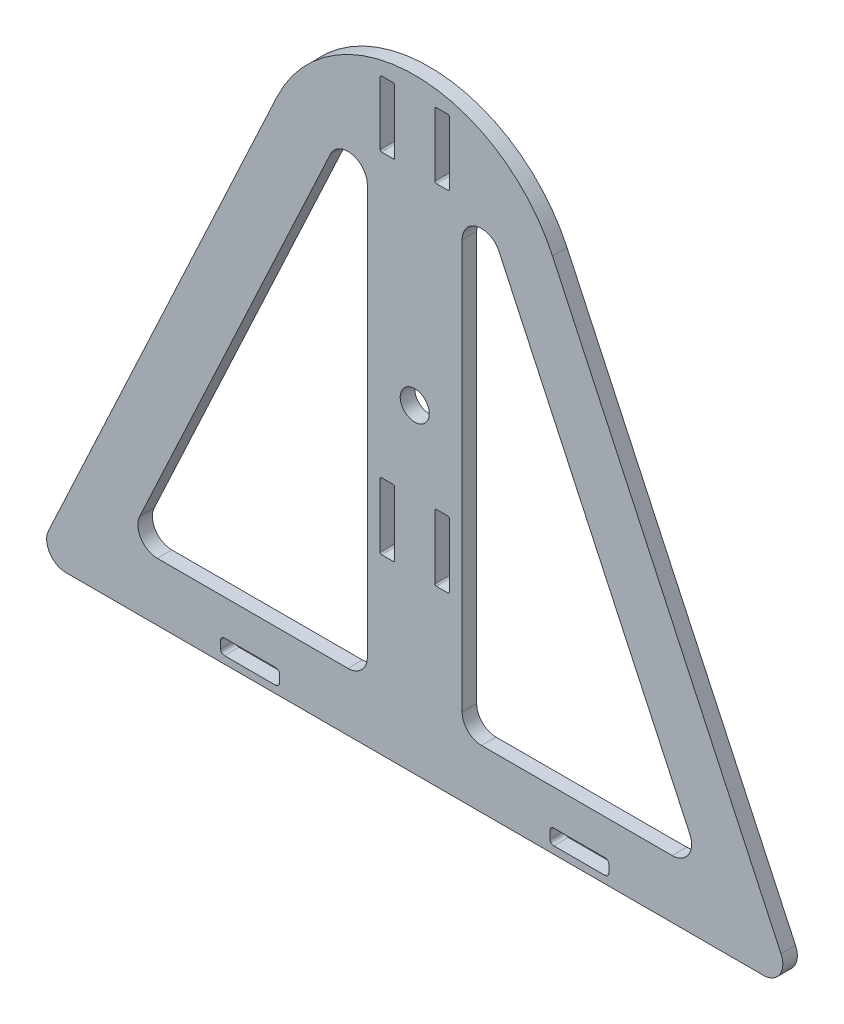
ISO-10303-21;
HEADER;
FILE_DESCRIPTION(('STEP AP214'),'2;1');
FILE_NAME('part.step','',(''),(''),'','','');
FILE_SCHEMA(('AUTOMOTIVE_DESIGN { 1 0 10303 214 1 1 1 1 }'));
ENDSEC;
DATA;
#1=APPLICATION_CONTEXT('core data for automotive mechanical design processes');
#2=APPLICATION_PROTOCOL_DEFINITION('international standard','automotive_design',2000,#1);
#3=PRODUCT_CONTEXT('',#1,'mechanical');
#4=PRODUCT('Part','Part','',(#3));
#5=PRODUCT_RELATED_PRODUCT_CATEGORY('part','',(#4));
#6=PRODUCT_DEFINITION_FORMATION('','',#4);
#7=PRODUCT_DEFINITION_CONTEXT('part definition',#1,'design');
#8=PRODUCT_DEFINITION('design','',#6,#7);
#9=PRODUCT_DEFINITION_SHAPE('','',#8);
#10=(LENGTH_UNIT() NAMED_UNIT(*) SI_UNIT(.MILLI.,.METRE.));
#11=(NAMED_UNIT(*) PLANE_ANGLE_UNIT() SI_UNIT($,.RADIAN.));
#12=(NAMED_UNIT(*) SI_UNIT($,.STERADIAN.) SOLID_ANGLE_UNIT());
#13=UNCERTAINTY_MEASURE_WITH_UNIT(LENGTH_MEASURE(1.E-05),#10,'distance_accuracy_value','');
#14=(GEOMETRIC_REPRESENTATION_CONTEXT(3) GLOBAL_UNCERTAINTY_ASSIGNED_CONTEXT((#13)) GLOBAL_UNIT_ASSIGNED_CONTEXT((#10,
#11,#12)) REPRESENTATION_CONTEXT('',''));
#15=CARTESIAN_POINT('',(0.,0.,0.));
#16=DIRECTION('',(0.,0.,1.));
#17=DIRECTION('',(1.,0.,0.));
#18=AXIS2_PLACEMENT_3D('',#15,#16,#17);
#19=CARTESIAN_POINT('',(0.,146.05,4.7625));
#20=DIRECTION('',(0.,0.,-1.));
#21=DIRECTION('',(-1.,0.,0.));
#22=AXIS2_PLACEMENT_3D('',#19,#20,#21);
#23=PLANE('',#22);
#24=DIRECTION('',(1.,0.,0.));
#25=VECTOR('',#24,1.);
#26=CARTESIAN_POINT('',(84.397489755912,16.51,4.7625));
#27=LINE('',#26,#25);
#28=CARTESIAN_POINT('',(21.8872064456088,16.51,4.7625));
#29=VERTEX_POINT('',#28);
#30=CARTESIAN_POINT('',(84.397489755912,16.51,4.7625));
#31=VERTEX_POINT('',#30);
#32=EDGE_CURVE('E481',#29,#31,#27,.T.);
#33=ORIENTED_EDGE('',*,*,#32,.F.);
#34=CARTESIAN_POINT('',(21.8872064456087,22.86,4.7625));
#35=DIRECTION('',(0.,0.,1.));
#36=DIRECTION('',(-1.,0.,0.));
#37=AXIS2_PLACEMENT_3D('',#34,#35,#36);
#38=CIRCLE('',#37,6.35);
#39=CARTESIAN_POINT('',(15.5372064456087,22.86,4.7625));
#40=VERTEX_POINT('',#39);
#41=EDGE_CURVE('E50',#40,#29,#38,.T.);
#42=ORIENTED_EDGE('',*,*,#41,.F.);
#43=DIRECTION('',(0.,-1.,0.));
#44=VECTOR('',#43,1.);
#45=CARTESIAN_POINT('',(15.5372064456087,22.86,4.7625));
#46=LINE('',#45,#44);
#47=CARTESIAN_POINT('',(15.5372064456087,156.913735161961,4.7625));
#48=VERTEX_POINT('',#47);
#49=EDGE_CURVE('E467',#48,#40,#46,.T.);
#50=ORIENTED_EDGE('',*,*,#49,.F.);
#51=CARTESIAN_POINT('',(21.8872064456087,156.913735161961,4.7625));
#52=DIRECTION('',(0.,0.,1.));
#53=DIRECTION('',(1.,0.,0.));
#54=AXIS2_PLACEMENT_3D('',#51,#52,#53);
#55=CIRCLE('',#54,6.35);
#56=CARTESIAN_POINT('',(27.6422608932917,159.597361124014,4.7625));
#57=VERTEX_POINT('',#56);
#58=EDGE_CURVE('E470',#57,#48,#55,.T.);
#59=ORIENTED_EDGE('',*,*,#58,.F.);
#60=DIRECTION('',(-0.422618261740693,0.906307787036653,0.));
#61=VECTOR('',#60,1.);
#62=CARTESIAN_POINT('',(27.6422608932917,159.597361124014,4.7625));
#63=LINE('',#62,#61);
#64=CARTESIAN_POINT('',(90.1525442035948,25.5436259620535,4.7625));
#65=VERTEX_POINT('',#64);
#66=EDGE_CURVE('E486',#65,#57,#63,.T.);
#67=ORIENTED_EDGE('',*,*,#66,.F.);
#68=CARTESIAN_POINT('',(84.3974897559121,22.86,4.7625));
#69=DIRECTION('',(0.,0.,1.));
#70=DIRECTION('',(1.,0.,0.));
#71=AXIS2_PLACEMENT_3D('',#68,#69,#70);
#72=CIRCLE('',#71,6.35);
#73=EDGE_CURVE('E483',#31,#65,#72,.T.);
#74=ORIENTED_EDGE('',*,*,#73,.F.);
#75=EDGE_LOOP('',(#33,#42,#50,#59,#67,#74));
#76=FACE_BOUND('',#75,.T.);
#77=DIRECTION('',(-0.422618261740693,-0.906307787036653,0.));
#78=VECTOR('',#77,1.);
#79=CARTESIAN_POINT('',(-27.6422608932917,159.597361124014,4.7625));
#80=LINE('',#79,#78);
#81=CARTESIAN_POINT('',(-27.6422608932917,159.597361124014,4.7625));
#82=VERTEX_POINT('',#81);
#83=CARTESIAN_POINT('',(-90.1525442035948,25.5436259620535,4.7625));
#84=VERTEX_POINT('',#83);
#85=EDGE_CURVE('E522',#82,#84,#80,.T.);
#86=ORIENTED_EDGE('',*,*,#85,.F.);
#87=CARTESIAN_POINT('',(-21.8872064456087,156.913735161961,4.7625));
#88=DIRECTION('',(0.,0.,1.));
#89=DIRECTION('',(1.,0.,0.));
#90=AXIS2_PLACEMENT_3D('',#87,#88,#89);
#91=CIRCLE('',#90,6.35);
#92=CARTESIAN_POINT('',(-15.5372064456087,156.913735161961,4.7625));
#93=VERTEX_POINT('',#92);
#94=EDGE_CURVE('E493',#93,#82,#91,.T.);
#95=ORIENTED_EDGE('',*,*,#94,.F.);
#96=DIRECTION('',(0.,1.,0.));
#97=VECTOR('',#96,1.);
#98=CARTESIAN_POINT('',(-15.5372064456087,22.86,4.7625));
#99=LINE('',#98,#97);
#100=CARTESIAN_POINT('',(-15.5372064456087,22.86,4.7625));
#101=VERTEX_POINT('',#100);
#102=EDGE_CURVE('E505',#101,#93,#99,.T.);
#103=ORIENTED_EDGE('',*,*,#102,.F.);
#104=CARTESIAN_POINT('',(-21.8872064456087,22.86,4.7625));
#105=DIRECTION('',(0.,0.,1.));
#106=DIRECTION('',(1.,0.,0.));
#107=AXIS2_PLACEMENT_3D('',#104,#105,#106);
#108=CIRCLE('',#107,6.35);
#109=CARTESIAN_POINT('',(-21.8872064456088,16.51,4.7625));
#110=VERTEX_POINT('',#109);
#111=EDGE_CURVE('E531',#110,#101,#108,.T.);
#112=ORIENTED_EDGE('',*,*,#111,.F.);
#113=DIRECTION('',(1.,0.,0.));
#114=VECTOR('',#113,1.);
#115=CARTESIAN_POINT('',(-84.397489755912,16.51,4.7625));
#116=LINE('',#115,#114);
#117=CARTESIAN_POINT('',(-84.397489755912,16.51,4.7625));
#118=VERTEX_POINT('',#117);
#119=EDGE_CURVE('E528',#118,#110,#116,.T.);
#120=ORIENTED_EDGE('',*,*,#119,.F.);
#121=CARTESIAN_POINT('',(-84.3974897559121,22.86,4.7625));
#122=DIRECTION('',(0.,0.,1.));
#123=DIRECTION('',(-1.,0.,0.));
#124=AXIS2_PLACEMENT_3D('',#121,#122,#123);
#125=CIRCLE('',#124,6.35);
#126=EDGE_CURVE('E525',#84,#118,#125,.T.);
#127=ORIENTED_EDGE('',*,*,#126,.F.);
#128=EDGE_LOOP('',(#86,#95,#103,#112,#120,#127));
#129=FACE_BOUND('',#128,.T.);
#130=CARTESIAN_POINT('',(0.,102.108,4.7625));
#131=DIRECTION('',(0.,0.,1.));
#132=DIRECTION('',(1.,0.,0.));
#133=AXIS2_PLACEMENT_3D('',#130,#131,#132);
#134=CIRCLE('',#133,4.7625);
#135=CARTESIAN_POINT('',(4.7625,102.108,4.7625));
#136=VERTEX_POINT('',#135);
#137=EDGE_CURVE('E538',#136,#136,#134,.T.);
#138=ORIENTED_EDGE('',*,*,#137,.F.);
#139=EDGE_LOOP('',(#138));
#140=FACE_BOUND('',#139,.T.);
#141=CARTESIAN_POINT('',(-10.8382064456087,75.6285,4.7625));
#142=DIRECTION('',(0.,0.,1.));
#143=DIRECTION('',(-1.,0.,0.));
#144=AXIS2_PLACEMENT_3D('',#141,#142,#143);
#145=CIRCLE('',#144,0.507999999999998);
#146=CARTESIAN_POINT('',(-10.8382064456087,76.1365,4.7625));
#147=VERTEX_POINT('',#146);
#148=CARTESIAN_POINT('',(-11.3462064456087,75.6285,4.7625));
#149=VERTEX_POINT('',#148);
#150=EDGE_CURVE('E614',#147,#149,#145,.T.);
#151=ORIENTED_EDGE('',*,*,#150,.F.);
#152=DIRECTION('',(-1.,0.,0.));
#153=VECTOR('',#152,1.);
#154=CARTESIAN_POINT('',(-7.09170644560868,76.1365,4.7625));
#155=LINE('',#154,#153);
#156=CARTESIAN_POINT('',(-7.09170644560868,76.1365,4.7625));
#157=VERTEX_POINT('',#156);
#158=EDGE_CURVE('E630',#157,#147,#155,.T.);
#159=ORIENTED_EDGE('',*,*,#158,.F.);
#160=CARTESIAN_POINT('',(-7.09170644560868,75.6285,4.7625));
#161=DIRECTION('',(0.,0.,1.));
#162=DIRECTION('',(1.,0.,0.));
#163=AXIS2_PLACEMENT_3D('',#160,#161,#162);
#164=CIRCLE('',#163,0.507999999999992);
#165=CARTESIAN_POINT('',(-6.58370644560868,75.6285,4.7625));
#166=VERTEX_POINT('',#165);
#167=EDGE_CURVE('E627',#166,#157,#164,.T.);
#168=ORIENTED_EDGE('',*,*,#167,.F.);
#169=DIRECTION('',(0.,1.,0.));
#170=VECTOR('',#169,1.);
#171=CARTESIAN_POINT('',(-6.58370644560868,54.8005,4.7625));
#172=LINE('',#171,#170);
#173=CARTESIAN_POINT('',(-6.58370644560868,54.8005,4.7625));
#174=VERTEX_POINT('',#173);
#175=EDGE_CURVE('E625',#174,#166,#172,.T.);
#176=ORIENTED_EDGE('',*,*,#175,.F.);
#177=CARTESIAN_POINT('',(-7.09170644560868,54.8005,4.7625));
#178=DIRECTION('',(0.,0.,1.));
#179=DIRECTION('',(-1.,0.,0.));
#180=AXIS2_PLACEMENT_3D('',#177,#178,#179);
#181=CIRCLE('',#180,0.508);
#182=CARTESIAN_POINT('',(-7.09170644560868,54.2925,4.7625));
#183=VERTEX_POINT('',#182);
#184=EDGE_CURVE('E623',#183,#174,#181,.T.);
#185=ORIENTED_EDGE('',*,*,#184,.F.);
#186=DIRECTION('',(1.,0.,0.));
#187=VECTOR('',#186,1.);
#188=CARTESIAN_POINT('',(-10.8382064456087,54.2925,4.7625));
#189=LINE('',#188,#187);
#190=CARTESIAN_POINT('',(-10.8382064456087,54.2925,4.7625));
#191=VERTEX_POINT('',#190);
#192=EDGE_CURVE('E621',#191,#183,#189,.T.);
#193=ORIENTED_EDGE('',*,*,#192,.F.);
#194=CARTESIAN_POINT('',(-10.8382064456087,54.8005,4.7625));
#195=DIRECTION('',(0.,0.,1.));
#196=DIRECTION('',(-1.,0.,0.));
#197=AXIS2_PLACEMENT_3D('',#194,#195,#196);
#198=CIRCLE('',#197,0.508000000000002);
#199=CARTESIAN_POINT('',(-11.3462064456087,54.8005,4.7625));
#200=VERTEX_POINT('',#199);
#201=EDGE_CURVE('E619',#200,#191,#198,.T.);
#202=ORIENTED_EDGE('',*,*,#201,.F.);
#203=DIRECTION('',(0.,-1.,0.));
#204=VECTOR('',#203,1.);
#205=CARTESIAN_POINT('',(-11.3462064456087,75.6285,4.7625));
#206=LINE('',#205,#204);
#207=EDGE_CURVE('E616',#149,#200,#206,.T.);
#208=ORIENTED_EDGE('',*,*,#207,.F.);
#209=EDGE_LOOP('',(#151,#159,#168,#176,#185,#193,#202,#208));
#210=FACE_BOUND('',#209,.T.);
#211=CARTESIAN_POINT('',(-7.09170644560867,189.6745,4.7625));
#212=DIRECTION('',(0.,0.,1.));
#213=DIRECTION('',(1.,0.,0.));
#214=AXIS2_PLACEMENT_3D('',#211,#212,#213);
#215=CIRCLE('',#214,0.508000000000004);
#216=CARTESIAN_POINT('',(-6.58370644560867,189.6745,4.7625));
#217=VERTEX_POINT('',#216);
#218=CARTESIAN_POINT('',(-7.09170644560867,190.1825,4.7625));
#219=VERTEX_POINT('',#218);
#220=EDGE_CURVE('E732',#217,#219,#215,.T.);
#221=ORIENTED_EDGE('',*,*,#220,.F.);
#222=DIRECTION('',(0.,1.,0.));
#223=VECTOR('',#222,1.);
#224=CARTESIAN_POINT('',(-6.58370644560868,169.1005,4.7625));
#225=LINE('',#224,#223);
#226=CARTESIAN_POINT('',(-6.58370644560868,169.1005,4.7625));
#227=VERTEX_POINT('',#226);
#228=EDGE_CURVE('E748',#227,#217,#225,.T.);
#229=ORIENTED_EDGE('',*,*,#228,.F.);
#230=CARTESIAN_POINT('',(-7.09170644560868,169.1005,4.7625));
#231=DIRECTION('',(0.,0.,1.));
#232=DIRECTION('',(1.,0.,0.));
#233=AXIS2_PLACEMENT_3D('',#230,#231,#232);
#234=CIRCLE('',#233,0.508000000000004);
#235=CARTESIAN_POINT('',(-7.09170644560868,168.5925,4.7625));
#236=VERTEX_POINT('',#235);
#237=EDGE_CURVE('E745',#236,#227,#234,.T.);
#238=ORIENTED_EDGE('',*,*,#237,.F.);
#239=DIRECTION('',(1.,0.,0.));
#240=VECTOR('',#239,1.);
#241=CARTESIAN_POINT('',(-10.8382064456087,168.5925,4.7625));
#242=LINE('',#241,#240);
#243=CARTESIAN_POINT('',(-10.8382064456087,168.5925,4.7625));
#244=VERTEX_POINT('',#243);
#245=EDGE_CURVE('E743',#244,#236,#242,.T.);
#246=ORIENTED_EDGE('',*,*,#245,.F.);
#247=CARTESIAN_POINT('',(-10.8382064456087,169.1005,4.7625));
#248=DIRECTION('',(0.,0.,1.));
#249=DIRECTION('',(-1.,0.,0.));
#250=AXIS2_PLACEMENT_3D('',#247,#248,#249);
#251=CIRCLE('',#250,0.508000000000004);
#252=CARTESIAN_POINT('',(-11.3462064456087,169.1005,4.7625));
#253=VERTEX_POINT('',#252);
#254=EDGE_CURVE('E741',#253,#244,#251,.T.);
#255=ORIENTED_EDGE('',*,*,#254,.F.);
#256=DIRECTION('',(0.,-1.,0.));
#257=VECTOR('',#256,1.);
#258=CARTESIAN_POINT('',(-11.3462064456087,189.6745,4.7625));
#259=LINE('',#258,#257);
#260=CARTESIAN_POINT('',(-11.3462064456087,189.6745,4.7625));
#261=VERTEX_POINT('',#260);
#262=EDGE_CURVE('E739',#261,#253,#259,.T.);
#263=ORIENTED_EDGE('',*,*,#262,.F.);
#264=CARTESIAN_POINT('',(-10.8382064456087,189.6745,4.7625));
#265=DIRECTION('',(0.,0.,1.));
#266=DIRECTION('',(-1.,0.,0.));
#267=AXIS2_PLACEMENT_3D('',#264,#265,#266);
#268=CIRCLE('',#267,0.508000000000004);
#269=CARTESIAN_POINT('',(-10.8382064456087,190.1825,4.7625));
#270=VERTEX_POINT('',#269);
#271=EDGE_CURVE('E737',#270,#261,#268,.T.);
#272=ORIENTED_EDGE('',*,*,#271,.F.);
#273=DIRECTION('',(-1.,0.,0.));
#274=VECTOR('',#273,1.);
#275=CARTESIAN_POINT('',(-10.8382064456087,190.1825,4.7625));
#276=LINE('',#275,#274);
#277=EDGE_CURVE('E734',#219,#270,#276,.T.);
#278=ORIENTED_EDGE('',*,*,#277,.F.);
#279=EDGE_LOOP('',(#221,#229,#238,#246,#255,#263,#272,#278));
#280=FACE_BOUND('',#279,.T.);
#281=CARTESIAN_POINT('',(-62.357,1.14300000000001,4.7625));
#282=DIRECTION('',(0.,0.,1.));
#283=DIRECTION('',(1.,0.,0.));
#284=AXIS2_PLACEMENT_3D('',#281,#282,#283);
#285=CIRCLE('',#284,1.27);
#286=CARTESIAN_POINT('',(-63.627,1.14300000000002,4.7625));
#287=VERTEX_POINT('',#286);
#288=CARTESIAN_POINT('',(-62.357,-0.126999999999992,4.7625));
#289=VERTEX_POINT('',#288);
#290=EDGE_CURVE('E850',#287,#289,#285,.T.);
#291=ORIENTED_EDGE('',*,*,#290,.F.);
#292=DIRECTION('',(0.,-1.,0.));
#293=VECTOR('',#292,1.);
#294=CARTESIAN_POINT('',(-63.627,3.6195,4.7625));
#295=LINE('',#294,#293);
#296=CARTESIAN_POINT('',(-63.627,3.6195,4.7625));
#297=VERTEX_POINT('',#296);
#298=EDGE_CURVE('E866',#297,#287,#295,.T.);
#299=ORIENTED_EDGE('',*,*,#298,.F.);
#300=CARTESIAN_POINT('',(-62.357,3.61950000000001,4.7625));
#301=DIRECTION('',(0.,0.,1.));
#302=DIRECTION('',(-1.,0.,0.));
#303=AXIS2_PLACEMENT_3D('',#300,#301,#302);
#304=CIRCLE('',#303,1.27);
#305=CARTESIAN_POINT('',(-62.357,4.88950000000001,4.7625));
#306=VERTEX_POINT('',#305);
#307=EDGE_CURVE('E863',#306,#297,#304,.T.);
#308=ORIENTED_EDGE('',*,*,#307,.F.);
#309=DIRECTION('',(-1.,0.,0.));
#310=VECTOR('',#309,1.);
#311=CARTESIAN_POINT('',(-45.593,4.88950000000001,4.7625));
#312=LINE('',#311,#310);
#313=CARTESIAN_POINT('',(-45.593,4.88950000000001,4.7625));
#314=VERTEX_POINT('',#313);
#315=EDGE_CURVE('E861',#314,#306,#312,.T.);
#316=ORIENTED_EDGE('',*,*,#315,.F.);
#317=CARTESIAN_POINT('',(-45.593,3.61950000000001,4.7625));
#318=DIRECTION('',(0.,0.,1.));
#319=DIRECTION('',(1.,0.,0.));
#320=AXIS2_PLACEMENT_3D('',#317,#318,#319);
#321=CIRCLE('',#320,1.27);
#322=CARTESIAN_POINT('',(-44.323,3.6195,4.7625));
#323=VERTEX_POINT('',#322);
#324=EDGE_CURVE('E859',#323,#314,#321,.T.);
#325=ORIENTED_EDGE('',*,*,#324,.F.);
#326=DIRECTION('',(0.,1.,0.));
#327=VECTOR('',#326,1.);
#328=CARTESIAN_POINT('',(-44.323,1.14300000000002,4.7625));
#329=LINE('',#328,#327);
#330=CARTESIAN_POINT('',(-44.323,1.14300000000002,4.7625));
#331=VERTEX_POINT('',#330);
#332=EDGE_CURVE('E857',#331,#323,#329,.T.);
#333=ORIENTED_EDGE('',*,*,#332,.F.);
#334=CARTESIAN_POINT('',(-45.593,1.14300000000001,4.7625));
#335=DIRECTION('',(0.,0.,1.));
#336=DIRECTION('',(1.,0.,0.));
#337=AXIS2_PLACEMENT_3D('',#334,#335,#336);
#338=CIRCLE('',#337,1.27);
#339=CARTESIAN_POINT('',(-45.593,-0.126999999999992,4.7625));
#340=VERTEX_POINT('',#339);
#341=EDGE_CURVE('E855',#340,#331,#338,.T.);
#342=ORIENTED_EDGE('',*,*,#341,.F.);
#343=DIRECTION('',(1.,0.,0.));
#344=VECTOR('',#343,1.);
#345=CARTESIAN_POINT('',(-62.357,-0.126999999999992,4.7625));
#346=LINE('',#345,#344);
#347=EDGE_CURVE('E852',#289,#340,#346,.T.);
#348=ORIENTED_EDGE('',*,*,#347,.F.);
#349=EDGE_LOOP('',(#291,#299,#308,#316,#325,#333,#342,#348));
#350=FACE_BOUND('',#349,.T.);
#351=CARTESIAN_POINT('',(0.,146.05,4.7625));
#352=DIRECTION('',(0.,0.,1.));
#353=DIRECTION('',(-1.,0.,0.));
#354=AXIS2_PLACEMENT_3D('',#351,#352,#353);
#355=CIRCLE('',#354,49.8277585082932);
#356=CARTESIAN_POINT('',(45.159285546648,167.10812068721,4.7625));
#357=VERTEX_POINT('',#356);
#358=CARTESIAN_POINT('',(-45.159285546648,167.10812068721,4.7625));
#359=VERTEX_POINT('',#358);
#360=EDGE_CURVE('E909',#357,#359,#355,.T.);
#361=ORIENTED_EDGE('',*,*,#360,.T.);
#362=DIRECTION('',(-0.422618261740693,-0.906307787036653,0.));
#363=VECTOR('',#362,1.);
#364=CARTESIAN_POINT('',(-120.055054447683,6.49362596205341,4.7625));
#365=LINE('',#364,#363);
#366=CARTESIAN_POINT('',(-120.055054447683,6.49362596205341,4.7625));
#367=VERTEX_POINT('',#366);
#368=EDGE_CURVE('E912',#359,#367,#365,.T.);
#369=ORIENTED_EDGE('',*,*,#368,.T.);
#370=CARTESIAN_POINT('',(-114.3,3.81000000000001,4.7625));
#371=DIRECTION('',(0.,0.,1.));
#372=DIRECTION('',(-1.,0.,0.));
#373=AXIS2_PLACEMENT_3D('',#370,#371,#372);
#374=CIRCLE('',#373,6.35);
#375=CARTESIAN_POINT('',(-114.3,-2.53999999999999,4.7625));
#376=VERTEX_POINT('',#375);
#377=EDGE_CURVE('E915',#367,#376,#374,.T.);
#378=ORIENTED_EDGE('',*,*,#377,.T.);
#379=DIRECTION('',(1.,0.,0.));
#380=VECTOR('',#379,1.);
#381=CARTESIAN_POINT('',(-114.3,-2.53999999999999,4.7625));
#382=LINE('',#381,#380);
#383=CARTESIAN_POINT('',(114.3,-2.53999999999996,4.7625));
#384=VERTEX_POINT('',#383);
#385=EDGE_CURVE('E917',#376,#384,#382,.T.);
#386=ORIENTED_EDGE('',*,*,#385,.T.);
#387=CARTESIAN_POINT('',(114.3,3.81000000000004,4.7625));
#388=DIRECTION('',(0.,0.,1.));
#389=DIRECTION('',(1.,0.,0.));
#390=AXIS2_PLACEMENT_3D('',#387,#388,#389);
#391=CIRCLE('',#390,6.35);
#392=CARTESIAN_POINT('',(120.055054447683,6.49362596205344,4.7625));
#393=VERTEX_POINT('',#392);
#394=EDGE_CURVE('E919',#384,#393,#391,.T.);
#395=ORIENTED_EDGE('',*,*,#394,.T.);
#396=DIRECTION('',(-0.422618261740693,0.906307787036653,0.));
#397=VECTOR('',#396,1.);
#398=CARTESIAN_POINT('',(120.055054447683,6.49362596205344,4.7625));
#399=LINE('',#398,#397);
#400=EDGE_CURVE('E921',#393,#357,#399,.T.);
#401=ORIENTED_EDGE('',*,*,#400,.T.);
#402=EDGE_LOOP('',(#361,#369,#378,#386,#395,#401));
#403=FACE_BOUND('',#402,.T.);
#404=CARTESIAN_POINT('',(7.09170644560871,169.1005,4.7625));
#405=DIRECTION('',(0.,0.,1.));
#406=DIRECTION('',(-1.,0.,0.));
#407=AXIS2_PLACEMENT_3D('',#404,#405,#406);
#408=CIRCLE('',#407,0.508000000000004);
#409=CARTESIAN_POINT('',(6.58370644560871,169.1005,4.7625));
#410=VERTEX_POINT('',#409);
#411=CARTESIAN_POINT('',(7.09170644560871,168.5925,4.7625));
#412=VERTEX_POINT('',#411);
#413=EDGE_CURVE('E791',#410,#412,#408,.T.);
#414=ORIENTED_EDGE('',*,*,#413,.F.);
#415=DIRECTION('',(0.,-1.,0.));
#416=VECTOR('',#415,1.);
#417=CARTESIAN_POINT('',(6.58370644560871,169.1005,4.7625));
#418=LINE('',#417,#416);
#419=CARTESIAN_POINT('',(6.58370644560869,189.6745,4.7625));
#420=VERTEX_POINT('',#419);
#421=EDGE_CURVE('E807',#420,#410,#418,.T.);
#422=ORIENTED_EDGE('',*,*,#421,.F.);
#423=CARTESIAN_POINT('',(7.09170644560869,189.6745,4.7625));
#424=DIRECTION('',(0.,0.,1.));
#425=DIRECTION('',(-1.,0.,0.));
#426=AXIS2_PLACEMENT_3D('',#423,#424,#425);
#427=CIRCLE('',#426,0.508000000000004);
#428=CARTESIAN_POINT('',(7.09170644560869,190.1825,4.7625));
#429=VERTEX_POINT('',#428);
#430=EDGE_CURVE('E804',#429,#420,#427,.T.);
#431=ORIENTED_EDGE('',*,*,#430,.F.);
#432=DIRECTION('',(-1.,0.,0.));
#433=VECTOR('',#432,1.);
#434=CARTESIAN_POINT('',(10.8382064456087,190.1825,4.7625));
#435=LINE('',#434,#433);
#436=CARTESIAN_POINT('',(10.8382064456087,190.1825,4.7625));
#437=VERTEX_POINT('',#436);
#438=EDGE_CURVE('E802',#437,#429,#435,.T.);
#439=ORIENTED_EDGE('',*,*,#438,.F.);
#440=CARTESIAN_POINT('',(10.8382064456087,189.6745,4.7625));
#441=DIRECTION('',(0.,0.,1.));
#442=DIRECTION('',(1.,0.,0.));
#443=AXIS2_PLACEMENT_3D('',#440,#441,#442);
#444=CIRCLE('',#443,0.508000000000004);
#445=CARTESIAN_POINT('',(11.3462064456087,189.6745,4.7625));
#446=VERTEX_POINT('',#445);
#447=EDGE_CURVE('E800',#446,#437,#444,.T.);
#448=ORIENTED_EDGE('',*,*,#447,.F.);
#449=DIRECTION('',(0.,1.,0.));
#450=VECTOR('',#449,1.);
#451=CARTESIAN_POINT('',(11.3462064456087,189.6745,4.7625));
#452=LINE('',#451,#450);
#453=CARTESIAN_POINT('',(11.3462064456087,169.1005,4.7625));
#454=VERTEX_POINT('',#453);
#455=EDGE_CURVE('E798',#454,#446,#452,.T.);
#456=ORIENTED_EDGE('',*,*,#455,.F.);
#457=CARTESIAN_POINT('',(10.8382064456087,169.1005,4.7625));
#458=DIRECTION('',(0.,0.,1.));
#459=DIRECTION('',(1.,0.,0.));
#460=AXIS2_PLACEMENT_3D('',#457,#458,#459);
#461=CIRCLE('',#460,0.508000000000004);
#462=CARTESIAN_POINT('',(10.8382064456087,168.5925,4.7625));
#463=VERTEX_POINT('',#462);
#464=EDGE_CURVE('E796',#463,#454,#461,.T.);
#465=ORIENTED_EDGE('',*,*,#464,.F.);
#466=DIRECTION('',(1.,0.,0.));
#467=VECTOR('',#466,1.);
#468=CARTESIAN_POINT('',(10.8382064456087,168.5925,4.7625));
#469=LINE('',#468,#467);
#470=EDGE_CURVE('E793',#412,#463,#469,.T.);
#471=ORIENTED_EDGE('',*,*,#470,.F.);
#472=EDGE_LOOP('',(#414,#422,#431,#439,#448,#456,#465,#471));
#473=FACE_BOUND('',#472,.T.);
#474=CARTESIAN_POINT('',(7.09170644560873,75.6285,4.7625));
#475=DIRECTION('',(0.,0.,1.));
#476=DIRECTION('',(-1.,0.,0.));
#477=AXIS2_PLACEMENT_3D('',#474,#475,#476);
#478=CIRCLE('',#477,0.507999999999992);
#479=CARTESIAN_POINT('',(7.09170644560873,76.1365,4.7625));
#480=VERTEX_POINT('',#479);
#481=CARTESIAN_POINT('',(6.58370644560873,75.6285,4.7625));
#482=VERTEX_POINT('',#481);
#483=EDGE_CURVE('E673',#480,#482,#478,.T.);
#484=ORIENTED_EDGE('',*,*,#483,.F.);
#485=DIRECTION('',(-1.,0.,0.));
#486=VECTOR('',#485,1.);
#487=CARTESIAN_POINT('',(7.09170644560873,76.1365,4.7625));
#488=LINE('',#487,#486);
#489=CARTESIAN_POINT('',(10.8382064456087,76.1365,4.7625));
#490=VERTEX_POINT('',#489);
#491=EDGE_CURVE('E689',#490,#480,#488,.T.);
#492=ORIENTED_EDGE('',*,*,#491,.F.);
#493=CARTESIAN_POINT('',(10.8382064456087,75.6285,4.7625));
#494=DIRECTION('',(0.,0.,1.));
#495=DIRECTION('',(1.,0.,0.));
#496=AXIS2_PLACEMENT_3D('',#493,#494,#495);
#497=CIRCLE('',#496,0.507999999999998);
#498=CARTESIAN_POINT('',(11.3462064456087,75.6285,4.7625));
#499=VERTEX_POINT('',#498);
#500=EDGE_CURVE('E686',#499,#490,#497,.T.);
#501=ORIENTED_EDGE('',*,*,#500,.F.);
#502=DIRECTION('',(0.,1.,0.));
#503=VECTOR('',#502,1.);
#504=CARTESIAN_POINT('',(11.3462064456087,75.6285,4.7625));
#505=LINE('',#504,#503);
#506=CARTESIAN_POINT('',(11.3462064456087,54.8005,4.7625));
#507=VERTEX_POINT('',#506);
#508=EDGE_CURVE('E684',#507,#499,#505,.T.);
#509=ORIENTED_EDGE('',*,*,#508,.F.);
#510=CARTESIAN_POINT('',(10.8382064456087,54.8005,4.7625));
#511=DIRECTION('',(0.,0.,1.));
#512=DIRECTION('',(1.,0.,0.));
#513=AXIS2_PLACEMENT_3D('',#510,#511,#512);
#514=CIRCLE('',#513,0.508000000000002);
#515=CARTESIAN_POINT('',(10.8382064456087,54.2925,4.7625));
#516=VERTEX_POINT('',#515);
#517=EDGE_CURVE('E682',#516,#507,#514,.T.);
#518=ORIENTED_EDGE('',*,*,#517,.F.);
#519=DIRECTION('',(1.,0.,0.));
#520=VECTOR('',#519,1.);
#521=CARTESIAN_POINT('',(10.8382064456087,54.2925,4.7625));
#522=LINE('',#521,#520);
#523=CARTESIAN_POINT('',(7.09170644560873,54.2925,4.7625));
#524=VERTEX_POINT('',#523);
#525=EDGE_CURVE('E680',#524,#516,#522,.T.);
#526=ORIENTED_EDGE('',*,*,#525,.F.);
#527=CARTESIAN_POINT('',(7.09170644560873,54.8005,4.7625));
#528=DIRECTION('',(0.,0.,1.));
#529=DIRECTION('',(1.,0.,0.));
#530=AXIS2_PLACEMENT_3D('',#527,#528,#529);
#531=CIRCLE('',#530,0.508);
#532=CARTESIAN_POINT('',(6.58370644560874,54.8005,4.7625));
#533=VERTEX_POINT('',#532);
#534=EDGE_CURVE('E678',#533,#524,#531,.T.);
#535=ORIENTED_EDGE('',*,*,#534,.F.);
#536=DIRECTION('',(0.,-1.,0.));
#537=VECTOR('',#536,1.);
#538=CARTESIAN_POINT('',(6.58370644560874,54.8005,4.7625));
#539=LINE('',#538,#537);
#540=EDGE_CURVE('E675',#482,#533,#539,.T.);
#541=ORIENTED_EDGE('',*,*,#540,.F.);
#542=EDGE_LOOP('',(#484,#492,#501,#509,#518,#526,#535,#541));
#543=FACE_BOUND('',#542,.T.);
#544=CARTESIAN_POINT('',(45.5930000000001,3.61950000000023,4.7625));
#545=DIRECTION('',(0.,0.,1.));
#546=DIRECTION('',(-1.,0.,0.));
#547=AXIS2_PLACEMENT_3D('',#544,#545,#546);
#548=CIRCLE('',#547,1.27);
#549=CARTESIAN_POINT('',(45.5930000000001,4.88950000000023,4.7625));
#550=VERTEX_POINT('',#549);
#551=CARTESIAN_POINT('',(44.3230000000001,3.61950000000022,4.7625));
#552=VERTEX_POINT('',#551);
#553=EDGE_CURVE('E555',#550,#552,#548,.T.);
#554=ORIENTED_EDGE('',*,*,#553,.F.);
#555=DIRECTION('',(-1.,0.,0.));
#556=VECTOR('',#555,1.);
#557=CARTESIAN_POINT('',(45.5930000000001,4.88950000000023,4.7625));
#558=LINE('',#557,#556);
#559=CARTESIAN_POINT('',(62.357,4.88950000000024,4.7625));
#560=VERTEX_POINT('',#559);
#561=EDGE_CURVE('E571',#560,#550,#558,.T.);
#562=ORIENTED_EDGE('',*,*,#561,.F.);
#563=CARTESIAN_POINT('',(62.3570000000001,3.61950000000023,4.7625));
#564=DIRECTION('',(0.,0.,1.));
#565=DIRECTION('',(1.,0.,0.));
#566=AXIS2_PLACEMENT_3D('',#563,#564,#565);
#567=CIRCLE('',#566,1.27);
#568=CARTESIAN_POINT('',(63.6270000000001,3.61950000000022,4.7625));
#569=VERTEX_POINT('',#568);
#570=EDGE_CURVE('E568',#569,#560,#567,.T.);
#571=ORIENTED_EDGE('',*,*,#570,.F.);
#572=DIRECTION('',(0.,1.,0.));
#573=VECTOR('',#572,1.);
#574=CARTESIAN_POINT('',(63.6270000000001,3.61950000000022,4.7625));
#575=LINE('',#574,#573);
#576=CARTESIAN_POINT('',(63.6270000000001,1.14300000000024,4.7625));
#577=VERTEX_POINT('',#576);
#578=EDGE_CURVE('E566',#577,#569,#575,.T.);
#579=ORIENTED_EDGE('',*,*,#578,.F.);
#580=CARTESIAN_POINT('',(62.3570000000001,1.14300000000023,4.7625));
#581=DIRECTION('',(0.,0.,1.));
#582=DIRECTION('',(1.,0.,0.));
#583=AXIS2_PLACEMENT_3D('',#580,#581,#582);
#584=CIRCLE('',#583,1.27);
#585=CARTESIAN_POINT('',(62.357,-0.12699999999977,4.7625));
#586=VERTEX_POINT('',#585);
#587=EDGE_CURVE('E564',#586,#577,#584,.T.);
#588=ORIENTED_EDGE('',*,*,#587,.F.);
#589=DIRECTION('',(1.,0.,0.));
#590=VECTOR('',#589,1.);
#591=CARTESIAN_POINT('',(62.357,-0.12699999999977,4.7625));
#592=LINE('',#591,#590);
#593=CARTESIAN_POINT('',(45.5930000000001,-0.12699999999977,4.7625));
#594=VERTEX_POINT('',#593);
#595=EDGE_CURVE('E562',#594,#586,#592,.T.);
#596=ORIENTED_EDGE('',*,*,#595,.F.);
#597=CARTESIAN_POINT('',(45.5930000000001,1.14300000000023,4.7625));
#598=DIRECTION('',(0.,0.,1.));
#599=DIRECTION('',(1.,0.,0.));
#600=AXIS2_PLACEMENT_3D('',#597,#598,#599);
#601=CIRCLE('',#600,1.27);
#602=CARTESIAN_POINT('',(44.3230000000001,1.14300000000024,4.7625));
#603=VERTEX_POINT('',#602);
#604=EDGE_CURVE('E560',#603,#594,#601,.T.);
#605=ORIENTED_EDGE('',*,*,#604,.F.);
#606=DIRECTION('',(0.,-1.,0.));
#607=VECTOR('',#606,1.);
#608=CARTESIAN_POINT('',(44.3230000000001,1.14300000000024,4.7625));
#609=LINE('',#608,#607);
#610=EDGE_CURVE('E557',#552,#603,#609,.T.);
#611=ORIENTED_EDGE('',*,*,#610,.F.);
#612=EDGE_LOOP('',(#554,#562,#571,#579,#588,#596,#605,#611));
#613=FACE_BOUND('',#612,.T.);
#614=ADVANCED_FACE('F35',(#76,#129,#140,#210,#280,#350,#403,#473,#543,#613),#23,.F.);
#615=CARTESIAN_POINT('',(0.,146.05,0.));
#616=DIRECTION('',(0.,0.,-1.));
#617=DIRECTION('',(-1.,0.,0.));
#618=AXIS2_PLACEMENT_3D('',#615,#616,#617);
#619=PLANE('',#618);
#620=CARTESIAN_POINT('',(21.8872064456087,22.86,0.));
#621=DIRECTION('',(0.,0.,1.));
#622=DIRECTION('',(-1.,0.,0.));
#623=AXIS2_PLACEMENT_3D('',#620,#621,#622);
#624=CIRCLE('',#623,6.35);
#625=CARTESIAN_POINT('',(15.5372064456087,22.86,0.));
#626=VERTEX_POINT('',#625);
#627=CARTESIAN_POINT('',(21.8872064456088,16.51,0.));
#628=VERTEX_POINT('',#627);
#629=EDGE_CURVE('E450',#626,#628,#624,.T.);
#630=ORIENTED_EDGE('',*,*,#629,.T.);
#631=DIRECTION('',(1.,0.,0.));
#632=VECTOR('',#631,1.);
#633=CARTESIAN_POINT('',(84.397489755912,16.51,0.));
#634=LINE('',#633,#632);
#635=CARTESIAN_POINT('',(84.397489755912,16.51,0.));
#636=VERTEX_POINT('',#635);
#637=EDGE_CURVE('E459',#628,#636,#634,.T.);
#638=ORIENTED_EDGE('',*,*,#637,.T.);
#639=CARTESIAN_POINT('',(84.3974897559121,22.86,0.));
#640=DIRECTION('',(0.,0.,1.));
#641=DIRECTION('',(1.,0.,0.));
#642=AXIS2_PLACEMENT_3D('',#639,#640,#641);
#643=CIRCLE('',#642,6.35);
#644=CARTESIAN_POINT('',(90.1525442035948,25.5436259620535,0.));
#645=VERTEX_POINT('',#644);
#646=EDGE_CURVE('E58',#636,#645,#643,.T.);
#647=ORIENTED_EDGE('',*,*,#646,.T.);
#648=DIRECTION('',(-0.422618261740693,0.906307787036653,0.));
#649=VECTOR('',#648,1.);
#650=CARTESIAN_POINT('',(27.6422608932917,159.597361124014,0.));
#651=LINE('',#650,#649);
#652=CARTESIAN_POINT('',(27.6422608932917,159.597361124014,0.));
#653=VERTEX_POINT('',#652);
#654=EDGE_CURVE('E474',#645,#653,#651,.T.);
#655=ORIENTED_EDGE('',*,*,#654,.T.);
#656=CARTESIAN_POINT('',(21.8872064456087,156.913735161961,0.));
#657=DIRECTION('',(0.,0.,1.));
#658=DIRECTION('',(1.,0.,0.));
#659=AXIS2_PLACEMENT_3D('',#656,#657,#658);
#660=CIRCLE('',#659,6.35);
#661=CARTESIAN_POINT('',(15.5372064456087,156.913735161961,0.));
#662=VERTEX_POINT('',#661);
#663=EDGE_CURVE('E477',#653,#662,#660,.T.);
#664=ORIENTED_EDGE('',*,*,#663,.T.);
#665=DIRECTION('',(0.,-1.,0.));
#666=VECTOR('',#665,1.);
#667=CARTESIAN_POINT('',(15.5372064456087,22.86,0.));
#668=LINE('',#667,#666);
#669=EDGE_CURVE('E456',#662,#626,#668,.T.);
#670=ORIENTED_EDGE('',*,*,#669,.T.);
#671=EDGE_LOOP('',(#630,#638,#647,#655,#664,#670));
#672=FACE_BOUND('',#671,.T.);
#673=CARTESIAN_POINT('',(-21.8872064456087,156.913735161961,0.));
#674=DIRECTION('',(0.,0.,1.));
#675=DIRECTION('',(1.,0.,0.));
#676=AXIS2_PLACEMENT_3D('',#673,#674,#675);
#677=CIRCLE('',#676,6.35);
#678=CARTESIAN_POINT('',(-15.5372064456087,156.913735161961,0.));
#679=VERTEX_POINT('',#678);
#680=CARTESIAN_POINT('',(-27.6422608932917,159.597361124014,0.));
#681=VERTEX_POINT('',#680);
#682=EDGE_CURVE('E501',#679,#681,#677,.T.);
#683=ORIENTED_EDGE('',*,*,#682,.T.);
#684=DIRECTION('',(-0.422618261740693,-0.906307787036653,0.));
#685=VECTOR('',#684,1.);
#686=CARTESIAN_POINT('',(-27.6422608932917,159.597361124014,0.));
#687=LINE('',#686,#685);
#688=CARTESIAN_POINT('',(-90.1525442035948,25.5436259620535,0.));
#689=VERTEX_POINT('',#688);
#690=EDGE_CURVE('E504',#681,#689,#687,.T.);
#691=ORIENTED_EDGE('',*,*,#690,.T.);
#692=CARTESIAN_POINT('',(-84.3974897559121,22.86,0.));
#693=DIRECTION('',(0.,0.,1.));
#694=DIRECTION('',(-1.,0.,0.));
#695=AXIS2_PLACEMENT_3D('',#692,#693,#694);
#696=CIRCLE('',#695,6.35);
#697=CARTESIAN_POINT('',(-84.397489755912,16.51,0.));
#698=VERTEX_POINT('',#697);
#699=EDGE_CURVE('E508',#689,#698,#696,.T.);
#700=ORIENTED_EDGE('',*,*,#699,.T.);
#701=DIRECTION('',(1.,0.,0.));
#702=VECTOR('',#701,1.);
#703=CARTESIAN_POINT('',(-84.397489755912,16.51,0.));
#704=LINE('',#703,#702);
#705=CARTESIAN_POINT('',(-21.8872064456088,16.51,0.));
#706=VERTEX_POINT('',#705);
#707=EDGE_CURVE('E511',#698,#706,#704,.T.);
#708=ORIENTED_EDGE('',*,*,#707,.T.);
#709=CARTESIAN_POINT('',(-21.8872064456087,22.86,0.));
#710=DIRECTION('',(0.,0.,1.));
#711=DIRECTION('',(1.,0.,0.));
#712=AXIS2_PLACEMENT_3D('',#709,#710,#711);
#713=CIRCLE('',#712,6.35);
#714=CARTESIAN_POINT('',(-15.5372064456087,22.86,0.));
#715=VERTEX_POINT('',#714);
#716=EDGE_CURVE('E514',#706,#715,#713,.T.);
#717=ORIENTED_EDGE('',*,*,#716,.T.);
#718=DIRECTION('',(0.,1.,0.));
#719=VECTOR('',#718,1.);
#720=CARTESIAN_POINT('',(-15.5372064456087,22.86,0.));
#721=LINE('',#720,#719);
#722=EDGE_CURVE('E517',#715,#679,#721,.T.);
#723=ORIENTED_EDGE('',*,*,#722,.T.);
#724=EDGE_LOOP('',(#683,#691,#700,#708,#717,#723));
#725=FACE_BOUND('',#724,.T.);
#726=CARTESIAN_POINT('',(0.,102.108,0.));
#727=DIRECTION('',(0.,0.,1.));
#728=DIRECTION('',(1.,0.,0.));
#729=AXIS2_PLACEMENT_3D('',#726,#727,#728);
#730=CIRCLE('',#729,4.7625);
#731=CARTESIAN_POINT('',(4.7625,102.108,0.));
#732=VERTEX_POINT('',#731);
#733=EDGE_CURVE('E549',#732,#732,#730,.T.);
#734=ORIENTED_EDGE('',*,*,#733,.T.);
#735=EDGE_LOOP('',(#734));
#736=FACE_BOUND('',#735,.T.);
#737=DIRECTION('',(-1.,0.,0.));
#738=VECTOR('',#737,1.);
#739=CARTESIAN_POINT('',(-7.09170644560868,76.1365,0.));
#740=LINE('',#739,#738);
#741=CARTESIAN_POINT('',(-7.09170644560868,76.1365,0.));
#742=VERTEX_POINT('',#741);
#743=CARTESIAN_POINT('',(-10.8382064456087,76.1365,0.));
#744=VERTEX_POINT('',#743);
#745=EDGE_CURVE('E617',#742,#744,#740,.T.);
#746=ORIENTED_EDGE('',*,*,#745,.T.);
#747=CARTESIAN_POINT('',(-10.8382064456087,75.6285,0.));
#748=DIRECTION('',(0.,0.,1.));
#749=DIRECTION('',(-1.,0.,0.));
#750=AXIS2_PLACEMENT_3D('',#747,#748,#749);
#751=CIRCLE('',#750,0.507999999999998);
#752=CARTESIAN_POINT('',(-11.3462064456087,75.6285,0.));
#753=VERTEX_POINT('',#752);
#754=EDGE_CURVE('E613',#744,#753,#751,.T.);
#755=ORIENTED_EDGE('',*,*,#754,.T.);
#756=DIRECTION('',(0.,-1.,0.));
#757=VECTOR('',#756,1.);
#758=CARTESIAN_POINT('',(-11.3462064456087,75.6285,0.));
#759=LINE('',#758,#757);
#760=CARTESIAN_POINT('',(-11.3462064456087,54.8005,0.));
#761=VERTEX_POINT('',#760);
#762=EDGE_CURVE('E635',#753,#761,#759,.T.);
#763=ORIENTED_EDGE('',*,*,#762,.T.);
#764=CARTESIAN_POINT('',(-10.8382064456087,54.8005,0.));
#765=DIRECTION('',(0.,0.,1.));
#766=DIRECTION('',(-1.,0.,0.));
#767=AXIS2_PLACEMENT_3D('',#764,#765,#766);
#768=CIRCLE('',#767,0.508000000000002);
#769=CARTESIAN_POINT('',(-10.8382064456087,54.2925,0.));
#770=VERTEX_POINT('',#769);
#771=EDGE_CURVE('E638',#761,#770,#768,.T.);
#772=ORIENTED_EDGE('',*,*,#771,.T.);
#773=DIRECTION('',(1.,0.,0.));
#774=VECTOR('',#773,1.);
#775=CARTESIAN_POINT('',(-10.8382064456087,54.2925,0.));
#776=LINE('',#775,#774);
#777=CARTESIAN_POINT('',(-7.09170644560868,54.2925,0.));
#778=VERTEX_POINT('',#777);
#779=EDGE_CURVE('E641',#770,#778,#776,.T.);
#780=ORIENTED_EDGE('',*,*,#779,.T.);
#781=CARTESIAN_POINT('',(-7.09170644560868,54.8005,0.));
#782=DIRECTION('',(0.,0.,1.));
#783=DIRECTION('',(-1.,0.,0.));
#784=AXIS2_PLACEMENT_3D('',#781,#782,#783);
#785=CIRCLE('',#784,0.508);
#786=CARTESIAN_POINT('',(-6.58370644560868,54.8005,0.));
#787=VERTEX_POINT('',#786);
#788=EDGE_CURVE('E644',#778,#787,#785,.T.);
#789=ORIENTED_EDGE('',*,*,#788,.T.);
#790=DIRECTION('',(0.,1.,0.));
#791=VECTOR('',#790,1.);
#792=CARTESIAN_POINT('',(-6.58370644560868,54.8005,0.));
#793=LINE('',#792,#791);
#794=CARTESIAN_POINT('',(-6.58370644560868,75.6285,0.));
#795=VERTEX_POINT('',#794);
#796=EDGE_CURVE('E647',#787,#795,#793,.T.);
#797=ORIENTED_EDGE('',*,*,#796,.T.);
#798=CARTESIAN_POINT('',(-7.09170644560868,75.6285,0.));
#799=DIRECTION('',(0.,0.,1.));
#800=DIRECTION('',(1.,0.,0.));
#801=AXIS2_PLACEMENT_3D('',#798,#799,#800);
#802=CIRCLE('',#801,0.507999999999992);
#803=EDGE_CURVE('E650',#795,#742,#802,.T.);
#804=ORIENTED_EDGE('',*,*,#803,.T.);
#805=EDGE_LOOP('',(#746,#755,#763,#772,#780,#789,#797,#804));
#806=FACE_BOUND('',#805,.T.);
#807=DIRECTION('',(0.,1.,0.));
#808=VECTOR('',#807,1.);
#809=CARTESIAN_POINT('',(-6.58370644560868,169.1005,0.));
#810=LINE('',#809,#808);
#811=CARTESIAN_POINT('',(-6.58370644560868,169.1005,0.));
#812=VERTEX_POINT('',#811);
#813=CARTESIAN_POINT('',(-6.58370644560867,189.6745,0.));
#814=VERTEX_POINT('',#813);
#815=EDGE_CURVE('E735',#812,#814,#810,.T.);
#816=ORIENTED_EDGE('',*,*,#815,.T.);
#817=CARTESIAN_POINT('',(-7.09170644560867,189.6745,0.));
#818=DIRECTION('',(0.,0.,1.));
#819=DIRECTION('',(1.,0.,0.));
#820=AXIS2_PLACEMENT_3D('',#817,#818,#819);
#821=CIRCLE('',#820,0.508000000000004);
#822=CARTESIAN_POINT('',(-7.09170644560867,190.1825,0.));
#823=VERTEX_POINT('',#822);
#824=EDGE_CURVE('E731',#814,#823,#821,.T.);
#825=ORIENTED_EDGE('',*,*,#824,.T.);
#826=DIRECTION('',(-1.,0.,0.));
#827=VECTOR('',#826,1.);
#828=CARTESIAN_POINT('',(-10.8382064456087,190.1825,0.));
#829=LINE('',#828,#827);
#830=CARTESIAN_POINT('',(-10.8382064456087,190.1825,0.));
#831=VERTEX_POINT('',#830);
#832=EDGE_CURVE('E753',#823,#831,#829,.T.);
#833=ORIENTED_EDGE('',*,*,#832,.T.);
#834=CARTESIAN_POINT('',(-10.8382064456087,189.6745,0.));
#835=DIRECTION('',(0.,0.,1.));
#836=DIRECTION('',(-1.,0.,0.));
#837=AXIS2_PLACEMENT_3D('',#834,#835,#836);
#838=CIRCLE('',#837,0.508000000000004);
#839=CARTESIAN_POINT('',(-11.3462064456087,189.6745,0.));
#840=VERTEX_POINT('',#839);
#841=EDGE_CURVE('E756',#831,#840,#838,.T.);
#842=ORIENTED_EDGE('',*,*,#841,.T.);
#843=DIRECTION('',(0.,-1.,0.));
#844=VECTOR('',#843,1.);
#845=CARTESIAN_POINT('',(-11.3462064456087,189.6745,0.));
#846=LINE('',#845,#844);
#847=CARTESIAN_POINT('',(-11.3462064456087,169.1005,0.));
#848=VERTEX_POINT('',#847);
#849=EDGE_CURVE('E759',#840,#848,#846,.T.);
#850=ORIENTED_EDGE('',*,*,#849,.T.);
#851=CARTESIAN_POINT('',(-10.8382064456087,169.1005,0.));
#852=DIRECTION('',(0.,0.,1.));
#853=DIRECTION('',(-1.,0.,0.));
#854=AXIS2_PLACEMENT_3D('',#851,#852,#853);
#855=CIRCLE('',#854,0.508000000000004);
#856=CARTESIAN_POINT('',(-10.8382064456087,168.5925,0.));
#857=VERTEX_POINT('',#856);
#858=EDGE_CURVE('E762',#848,#857,#855,.T.);
#859=ORIENTED_EDGE('',*,*,#858,.T.);
#860=DIRECTION('',(1.,0.,0.));
#861=VECTOR('',#860,1.);
#862=CARTESIAN_POINT('',(-10.8382064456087,168.5925,0.));
#863=LINE('',#862,#861);
#864=CARTESIAN_POINT('',(-7.09170644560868,168.5925,0.));
#865=VERTEX_POINT('',#864);
#866=EDGE_CURVE('E765',#857,#865,#863,.T.);
#867=ORIENTED_EDGE('',*,*,#866,.T.);
#868=CARTESIAN_POINT('',(-7.09170644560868,169.1005,0.));
#869=DIRECTION('',(0.,0.,1.));
#870=DIRECTION('',(1.,0.,0.));
#871=AXIS2_PLACEMENT_3D('',#868,#869,#870);
#872=CIRCLE('',#871,0.508000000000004);
#873=EDGE_CURVE('E768',#865,#812,#872,.T.);
#874=ORIENTED_EDGE('',*,*,#873,.T.);
#875=EDGE_LOOP('',(#816,#825,#833,#842,#850,#859,#867,#874));
#876=FACE_BOUND('',#875,.T.);
#877=DIRECTION('',(0.,-1.,0.));
#878=VECTOR('',#877,1.);
#879=CARTESIAN_POINT('',(-63.627,3.6195,0.));
#880=LINE('',#879,#878);
#881=CARTESIAN_POINT('',(-63.627,3.6195,0.));
#882=VERTEX_POINT('',#881);
#883=CARTESIAN_POINT('',(-63.627,1.14300000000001,0.));
#884=VERTEX_POINT('',#883);
#885=EDGE_CURVE('E853',#882,#884,#880,.T.);
#886=ORIENTED_EDGE('',*,*,#885,.T.);
#887=CARTESIAN_POINT('',(-62.357,1.14300000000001,0.));
#888=DIRECTION('',(0.,0.,1.));
#889=DIRECTION('',(1.,0.,0.));
#890=AXIS2_PLACEMENT_3D('',#887,#888,#889);
#891=CIRCLE('',#890,1.27);
#892=CARTESIAN_POINT('',(-62.357,-0.126999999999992,0.));
#893=VERTEX_POINT('',#892);
#894=EDGE_CURVE('E849',#884,#893,#891,.T.);
#895=ORIENTED_EDGE('',*,*,#894,.T.);
#896=DIRECTION('',(1.,0.,0.));
#897=VECTOR('',#896,1.);
#898=CARTESIAN_POINT('',(-62.357,-0.126999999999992,0.));
#899=LINE('',#898,#897);
#900=CARTESIAN_POINT('',(-45.593,-0.126999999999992,0.));
#901=VERTEX_POINT('',#900);
#902=EDGE_CURVE('E871',#893,#901,#899,.T.);
#903=ORIENTED_EDGE('',*,*,#902,.T.);
#904=CARTESIAN_POINT('',(-45.593,1.14300000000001,0.));
#905=DIRECTION('',(0.,0.,1.));
#906=DIRECTION('',(1.,0.,0.));
#907=AXIS2_PLACEMENT_3D('',#904,#905,#906);
#908=CIRCLE('',#907,1.27);
#909=CARTESIAN_POINT('',(-44.323,1.14300000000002,0.));
#910=VERTEX_POINT('',#909);
#911=EDGE_CURVE('E874',#901,#910,#908,.T.);
#912=ORIENTED_EDGE('',*,*,#911,.T.);
#913=DIRECTION('',(0.,1.,0.));
#914=VECTOR('',#913,1.);
#915=CARTESIAN_POINT('',(-44.323,1.14300000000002,0.));
#916=LINE('',#915,#914);
#917=CARTESIAN_POINT('',(-44.323,3.6195,0.));
#918=VERTEX_POINT('',#917);
#919=EDGE_CURVE('E877',#910,#918,#916,.T.);
#920=ORIENTED_EDGE('',*,*,#919,.T.);
#921=CARTESIAN_POINT('',(-45.593,3.61950000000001,0.));
#922=DIRECTION('',(0.,0.,1.));
#923=DIRECTION('',(1.,0.,0.));
#924=AXIS2_PLACEMENT_3D('',#921,#922,#923);
#925=CIRCLE('',#924,1.27);
#926=CARTESIAN_POINT('',(-45.593,4.88950000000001,0.));
#927=VERTEX_POINT('',#926);
#928=EDGE_CURVE('E880',#918,#927,#925,.T.);
#929=ORIENTED_EDGE('',*,*,#928,.T.);
#930=DIRECTION('',(-1.,0.,0.));
#931=VECTOR('',#930,1.);
#932=CARTESIAN_POINT('',(-45.593,4.88950000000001,0.));
#933=LINE('',#932,#931);
#934=CARTESIAN_POINT('',(-62.357,4.88950000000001,0.));
#935=VERTEX_POINT('',#934);
#936=EDGE_CURVE('E883',#927,#935,#933,.T.);
#937=ORIENTED_EDGE('',*,*,#936,.T.);
#938=CARTESIAN_POINT('',(-62.357,3.61950000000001,0.));
#939=DIRECTION('',(0.,0.,1.));
#940=DIRECTION('',(-1.,0.,0.));
#941=AXIS2_PLACEMENT_3D('',#938,#939,#940);
#942=CIRCLE('',#941,1.27);
#943=EDGE_CURVE('E886',#935,#882,#942,.T.);
#944=ORIENTED_EDGE('',*,*,#943,.T.);
#945=EDGE_LOOP('',(#886,#895,#903,#912,#920,#929,#937,#944));
#946=FACE_BOUND('',#945,.T.);
#947=CARTESIAN_POINT('',(0.,146.05,0.));
#948=DIRECTION('',(0.,0.,1.));
#949=DIRECTION('',(-1.,0.,0.));
#950=AXIS2_PLACEMENT_3D('',#947,#948,#949);
#951=CIRCLE('',#950,49.8277585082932);
#952=CARTESIAN_POINT('',(45.159285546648,167.10812068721,0.));
#953=VERTEX_POINT('',#952);
#954=CARTESIAN_POINT('',(-45.159285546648,167.10812068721,0.));
#955=VERTEX_POINT('',#954);
#956=EDGE_CURVE('E908',#953,#955,#951,.T.);
#957=ORIENTED_EDGE('',*,*,#956,.F.);
#958=DIRECTION('',(-0.422618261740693,0.906307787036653,0.));
#959=VECTOR('',#958,1.);
#960=CARTESIAN_POINT('',(120.055054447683,6.49362596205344,0.));
#961=LINE('',#960,#959);
#962=CARTESIAN_POINT('',(120.055054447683,6.49362596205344,0.));
#963=VERTEX_POINT('',#962);
#964=EDGE_CURVE('E913',#963,#953,#961,.T.);
#965=ORIENTED_EDGE('',*,*,#964,.F.);
#966=CARTESIAN_POINT('',(114.3,3.81000000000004,0.));
#967=DIRECTION('',(0.,0.,1.));
#968=DIRECTION('',(1.,0.,0.));
#969=AXIS2_PLACEMENT_3D('',#966,#967,#968);
#970=CIRCLE('',#969,6.35);
#971=CARTESIAN_POINT('',(114.3,-2.53999999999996,0.));
#972=VERTEX_POINT('',#971);
#973=EDGE_CURVE('E933',#972,#963,#970,.T.);
#974=ORIENTED_EDGE('',*,*,#973,.F.);
#975=DIRECTION('',(1.,0.,0.));
#976=VECTOR('',#975,1.);
#977=CARTESIAN_POINT('',(114.3,-2.53999999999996,0.));
#978=LINE('',#977,#976);
#979=CARTESIAN_POINT('',(-114.3,-2.53999999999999,0.));
#980=VERTEX_POINT('',#979);
#981=EDGE_CURVE('E931',#980,#972,#978,.T.);
#982=ORIENTED_EDGE('',*,*,#981,.F.);
#983=CARTESIAN_POINT('',(-114.3,3.81000000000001,0.));
#984=DIRECTION('',(0.,0.,1.));
#985=DIRECTION('',(-1.,0.,0.));
#986=AXIS2_PLACEMENT_3D('',#983,#984,#985);
#987=CIRCLE('',#986,6.35);
#988=CARTESIAN_POINT('',(-120.055054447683,6.49362596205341,0.));
#989=VERTEX_POINT('',#988);
#990=EDGE_CURVE('E928',#989,#980,#987,.T.);
#991=ORIENTED_EDGE('',*,*,#990,.F.);
#992=DIRECTION('',(-0.422618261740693,-0.906307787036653,0.));
#993=VECTOR('',#992,1.);
#994=CARTESIAN_POINT('',(-120.055054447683,6.49362596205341,0.));
#995=LINE('',#994,#993);
#996=EDGE_CURVE('E926',#955,#989,#995,.T.);
#997=ORIENTED_EDGE('',*,*,#996,.F.);
#998=EDGE_LOOP('',(#957,#965,#974,#982,#991,#997));
#999=FACE_BOUND('',#998,.T.);
#1000=DIRECTION('',(0.,-1.,0.));
#1001=VECTOR('',#1000,1.);
#1002=CARTESIAN_POINT('',(6.58370644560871,169.1005,0.));
#1003=LINE('',#1002,#1001);
#1004=CARTESIAN_POINT('',(6.58370644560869,189.6745,0.));
#1005=VERTEX_POINT('',#1004);
#1006=CARTESIAN_POINT('',(6.58370644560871,169.1005,0.));
#1007=VERTEX_POINT('',#1006);
#1008=EDGE_CURVE('E794',#1005,#1007,#1003,.T.);
#1009=ORIENTED_EDGE('',*,*,#1008,.T.);
#1010=CARTESIAN_POINT('',(7.09170644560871,169.1005,0.));
#1011=DIRECTION('',(0.,0.,1.));
#1012=DIRECTION('',(-1.,0.,0.));
#1013=AXIS2_PLACEMENT_3D('',#1010,#1011,#1012);
#1014=CIRCLE('',#1013,0.508000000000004);
#1015=CARTESIAN_POINT('',(7.09170644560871,168.5925,0.));
#1016=VERTEX_POINT('',#1015);
#1017=EDGE_CURVE('E790',#1007,#1016,#1014,.T.);
#1018=ORIENTED_EDGE('',*,*,#1017,.T.);
#1019=DIRECTION('',(1.,0.,0.));
#1020=VECTOR('',#1019,1.);
#1021=CARTESIAN_POINT('',(10.8382064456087,168.5925,0.));
#1022=LINE('',#1021,#1020);
#1023=CARTESIAN_POINT('',(10.8382064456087,168.5925,0.));
#1024=VERTEX_POINT('',#1023);
#1025=EDGE_CURVE('E812',#1016,#1024,#1022,.T.);
#1026=ORIENTED_EDGE('',*,*,#1025,.T.);
#1027=CARTESIAN_POINT('',(10.8382064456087,169.1005,0.));
#1028=DIRECTION('',(0.,0.,1.));
#1029=DIRECTION('',(1.,0.,0.));
#1030=AXIS2_PLACEMENT_3D('',#1027,#1028,#1029);
#1031=CIRCLE('',#1030,0.508000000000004);
#1032=CARTESIAN_POINT('',(11.3462064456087,169.1005,0.));
#1033=VERTEX_POINT('',#1032);
#1034=EDGE_CURVE('E815',#1024,#1033,#1031,.T.);
#1035=ORIENTED_EDGE('',*,*,#1034,.T.);
#1036=DIRECTION('',(0.,1.,0.));
#1037=VECTOR('',#1036,1.);
#1038=CARTESIAN_POINT('',(11.3462064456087,189.6745,0.));
#1039=LINE('',#1038,#1037);
#1040=CARTESIAN_POINT('',(11.3462064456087,189.6745,0.));
#1041=VERTEX_POINT('',#1040);
#1042=EDGE_CURVE('E818',#1033,#1041,#1039,.T.);
#1043=ORIENTED_EDGE('',*,*,#1042,.T.);
#1044=CARTESIAN_POINT('',(10.8382064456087,189.6745,0.));
#1045=DIRECTION('',(0.,0.,1.));
#1046=DIRECTION('',(1.,0.,0.));
#1047=AXIS2_PLACEMENT_3D('',#1044,#1045,#1046);
#1048=CIRCLE('',#1047,0.508000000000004);
#1049=CARTESIAN_POINT('',(10.8382064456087,190.1825,0.));
#1050=VERTEX_POINT('',#1049);
#1051=EDGE_CURVE('E821',#1041,#1050,#1048,.T.);
#1052=ORIENTED_EDGE('',*,*,#1051,.T.);
#1053=DIRECTION('',(-1.,0.,0.));
#1054=VECTOR('',#1053,1.);
#1055=CARTESIAN_POINT('',(10.8382064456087,190.1825,0.));
#1056=LINE('',#1055,#1054);
#1057=CARTESIAN_POINT('',(7.09170644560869,190.1825,0.));
#1058=VERTEX_POINT('',#1057);
#1059=EDGE_CURVE('E824',#1050,#1058,#1056,.T.);
#1060=ORIENTED_EDGE('',*,*,#1059,.T.);
#1061=CARTESIAN_POINT('',(7.09170644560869,189.6745,0.));
#1062=DIRECTION('',(0.,0.,1.));
#1063=DIRECTION('',(-1.,0.,0.));
#1064=AXIS2_PLACEMENT_3D('',#1061,#1062,#1063);
#1065=CIRCLE('',#1064,0.508000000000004);
#1066=EDGE_CURVE('E827',#1058,#1005,#1065,.T.);
#1067=ORIENTED_EDGE('',*,*,#1066,.T.);
#1068=EDGE_LOOP('',(#1009,#1018,#1026,#1035,#1043,#1052,#1060,#1067));
#1069=FACE_BOUND('',#1068,.T.);
#1070=DIRECTION('',(-1.,0.,0.));
#1071=VECTOR('',#1070,1.);
#1072=CARTESIAN_POINT('',(7.09170644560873,76.1365,0.));
#1073=LINE('',#1072,#1071);
#1074=CARTESIAN_POINT('',(10.8382064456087,76.1365,0.));
#1075=VERTEX_POINT('',#1074);
#1076=CARTESIAN_POINT('',(7.09170644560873,76.1365,0.));
#1077=VERTEX_POINT('',#1076);
#1078=EDGE_CURVE('E676',#1075,#1077,#1073,.T.);
#1079=ORIENTED_EDGE('',*,*,#1078,.T.);
#1080=CARTESIAN_POINT('',(7.09170644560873,75.6285,0.));
#1081=DIRECTION('',(0.,0.,1.));
#1082=DIRECTION('',(-1.,0.,0.));
#1083=AXIS2_PLACEMENT_3D('',#1080,#1081,#1082);
#1084=CIRCLE('',#1083,0.507999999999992);
#1085=CARTESIAN_POINT('',(6.58370644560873,75.6285,0.));
#1086=VERTEX_POINT('',#1085);
#1087=EDGE_CURVE('E672',#1077,#1086,#1084,.T.);
#1088=ORIENTED_EDGE('',*,*,#1087,.T.);
#1089=DIRECTION('',(0.,-1.,0.));
#1090=VECTOR('',#1089,1.);
#1091=CARTESIAN_POINT('',(6.58370644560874,54.8005,0.));
#1092=LINE('',#1091,#1090);
#1093=CARTESIAN_POINT('',(6.58370644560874,54.8005,0.));
#1094=VERTEX_POINT('',#1093);
#1095=EDGE_CURVE('E694',#1086,#1094,#1092,.T.);
#1096=ORIENTED_EDGE('',*,*,#1095,.T.);
#1097=CARTESIAN_POINT('',(7.09170644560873,54.8005,0.));
#1098=DIRECTION('',(0.,0.,1.));
#1099=DIRECTION('',(1.,0.,0.));
#1100=AXIS2_PLACEMENT_3D('',#1097,#1098,#1099);
#1101=CIRCLE('',#1100,0.508);
#1102=CARTESIAN_POINT('',(7.09170644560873,54.2925,0.));
#1103=VERTEX_POINT('',#1102);
#1104=EDGE_CURVE('E697',#1094,#1103,#1101,.T.);
#1105=ORIENTED_EDGE('',*,*,#1104,.T.);
#1106=DIRECTION('',(1.,0.,0.));
#1107=VECTOR('',#1106,1.);
#1108=CARTESIAN_POINT('',(10.8382064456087,54.2925,0.));
#1109=LINE('',#1108,#1107);
#1110=CARTESIAN_POINT('',(10.8382064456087,54.2925,0.));
#1111=VERTEX_POINT('',#1110);
#1112=EDGE_CURVE('E700',#1103,#1111,#1109,.T.);
#1113=ORIENTED_EDGE('',*,*,#1112,.T.);
#1114=CARTESIAN_POINT('',(10.8382064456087,54.8005,0.));
#1115=DIRECTION('',(0.,0.,1.));
#1116=DIRECTION('',(1.,0.,0.));
#1117=AXIS2_PLACEMENT_3D('',#1114,#1115,#1116);
#1118=CIRCLE('',#1117,0.508000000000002);
#1119=CARTESIAN_POINT('',(11.3462064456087,54.8005,0.));
#1120=VERTEX_POINT('',#1119);
#1121=EDGE_CURVE('E703',#1111,#1120,#1118,.T.);
#1122=ORIENTED_EDGE('',*,*,#1121,.T.);
#1123=DIRECTION('',(0.,1.,0.));
#1124=VECTOR('',#1123,1.);
#1125=CARTESIAN_POINT('',(11.3462064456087,75.6285,0.));
#1126=LINE('',#1125,#1124);
#1127=CARTESIAN_POINT('',(11.3462064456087,75.6285,0.));
#1128=VERTEX_POINT('',#1127);
#1129=EDGE_CURVE('E706',#1120,#1128,#1126,.T.);
#1130=ORIENTED_EDGE('',*,*,#1129,.T.);
#1131=CARTESIAN_POINT('',(10.8382064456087,75.6285,0.));
#1132=DIRECTION('',(0.,0.,1.));
#1133=DIRECTION('',(1.,0.,0.));
#1134=AXIS2_PLACEMENT_3D('',#1131,#1132,#1133);
#1135=CIRCLE('',#1134,0.507999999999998);
#1136=EDGE_CURVE('E709',#1128,#1075,#1135,.T.);
#1137=ORIENTED_EDGE('',*,*,#1136,.T.);
#1138=EDGE_LOOP('',(#1079,#1088,#1096,#1105,#1113,#1122,#1130,#1137));
#1139=FACE_BOUND('',#1138,.T.);
#1140=DIRECTION('',(-1.,0.,0.));
#1141=VECTOR('',#1140,1.);
#1142=CARTESIAN_POINT('',(45.5930000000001,4.88950000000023,0.));
#1143=LINE('',#1142,#1141);
#1144=CARTESIAN_POINT('',(62.357,4.88950000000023,0.));
#1145=VERTEX_POINT('',#1144);
#1146=CARTESIAN_POINT('',(45.5930000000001,4.88950000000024,0.));
#1147=VERTEX_POINT('',#1146);
#1148=EDGE_CURVE('E558',#1145,#1147,#1143,.T.);
#1149=ORIENTED_EDGE('',*,*,#1148,.T.);
#1150=CARTESIAN_POINT('',(45.5930000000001,3.61950000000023,0.));
#1151=DIRECTION('',(0.,0.,1.));
#1152=DIRECTION('',(-1.,0.,0.));
#1153=AXIS2_PLACEMENT_3D('',#1150,#1151,#1152);
#1154=CIRCLE('',#1153,1.27);
#1155=CARTESIAN_POINT('',(44.3230000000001,3.61950000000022,0.));
#1156=VERTEX_POINT('',#1155);
#1157=EDGE_CURVE('E552',#1147,#1156,#1154,.T.);
#1158=ORIENTED_EDGE('',*,*,#1157,.T.);
#1159=DIRECTION('',(0.,-1.,0.));
#1160=VECTOR('',#1159,1.);
#1161=CARTESIAN_POINT('',(44.3230000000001,1.14300000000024,0.));
#1162=LINE('',#1161,#1160);
#1163=CARTESIAN_POINT('',(44.3230000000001,1.14300000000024,0.));
#1164=VERTEX_POINT('',#1163);
#1165=EDGE_CURVE('E576',#1156,#1164,#1162,.T.);
#1166=ORIENTED_EDGE('',*,*,#1165,.T.);
#1167=CARTESIAN_POINT('',(45.5930000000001,1.14300000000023,0.));
#1168=DIRECTION('',(0.,0.,1.));
#1169=DIRECTION('',(1.,0.,0.));
#1170=AXIS2_PLACEMENT_3D('',#1167,#1168,#1169);
#1171=CIRCLE('',#1170,1.27);
#1172=CARTESIAN_POINT('',(45.5930000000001,-0.12699999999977,0.));
#1173=VERTEX_POINT('',#1172);
#1174=EDGE_CURVE('E579',#1164,#1173,#1171,.T.);
#1175=ORIENTED_EDGE('',*,*,#1174,.T.);
#1176=DIRECTION('',(1.,0.,0.));
#1177=VECTOR('',#1176,1.);
#1178=CARTESIAN_POINT('',(62.357,-0.12699999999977,0.));
#1179=LINE('',#1178,#1177);
#1180=CARTESIAN_POINT('',(62.357,-0.12699999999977,0.));
#1181=VERTEX_POINT('',#1180);
#1182=EDGE_CURVE('E582',#1173,#1181,#1179,.T.);
#1183=ORIENTED_EDGE('',*,*,#1182,.T.);
#1184=CARTESIAN_POINT('',(62.3570000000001,1.14300000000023,0.));
#1185=DIRECTION('',(0.,0.,1.));
#1186=DIRECTION('',(1.,0.,0.));
#1187=AXIS2_PLACEMENT_3D('',#1184,#1185,#1186);
#1188=CIRCLE('',#1187,1.27);
#1189=CARTESIAN_POINT('',(63.6270000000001,1.14300000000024,0.));
#1190=VERTEX_POINT('',#1189);
#1191=EDGE_CURVE('E585',#1181,#1190,#1188,.T.);
#1192=ORIENTED_EDGE('',*,*,#1191,.T.);
#1193=DIRECTION('',(0.,1.,0.));
#1194=VECTOR('',#1193,1.);
#1195=CARTESIAN_POINT('',(63.6270000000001,3.61950000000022,0.));
#1196=LINE('',#1195,#1194);
#1197=CARTESIAN_POINT('',(63.6270000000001,3.61950000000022,0.));
#1198=VERTEX_POINT('',#1197);
#1199=EDGE_CURVE('E588',#1190,#1198,#1196,.T.);
#1200=ORIENTED_EDGE('',*,*,#1199,.T.);
#1201=CARTESIAN_POINT('',(62.3570000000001,3.61950000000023,0.));
#1202=DIRECTION('',(0.,0.,1.));
#1203=DIRECTION('',(1.,0.,0.));
#1204=AXIS2_PLACEMENT_3D('',#1201,#1202,#1203);
#1205=CIRCLE('',#1204,1.27);
#1206=EDGE_CURVE('E591',#1198,#1145,#1205,.T.);
#1207=ORIENTED_EDGE('',*,*,#1206,.T.);
#1208=EDGE_LOOP('',(#1149,#1158,#1166,#1175,#1183,#1192,#1200,#1207));
#1209=FACE_BOUND('',#1208,.T.);
#1210=ADVANCED_FACE('F463',(#672,#725,#736,#806,#876,#946,#999,#1069,#1139,#1209),#619,.T.);
#1211=CARTESIAN_POINT('',(0.,146.05,4.7625));
#1212=DIRECTION('',(0.,0.,-1.));
#1213=DIRECTION('',(-1.,0.,0.));
#1214=AXIS2_PLACEMENT_3D('',#1211,#1212,#1213);
#1215=CYLINDRICAL_SURFACE('',#1214,49.8277585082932);
#1216=ORIENTED_EDGE('',*,*,#956,.T.);
#1217=DIRECTION('',(0.,0.,-1.));
#1218=VECTOR('',#1217,1.);
#1219=CARTESIAN_POINT('',(-45.159285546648,167.10812068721,4.7625));
#1220=LINE('',#1219,#1218);
#1221=EDGE_CURVE('E11',#359,#955,#1220,.T.);
#1222=ORIENTED_EDGE('',*,*,#1221,.F.);
#1223=ORIENTED_EDGE('',*,*,#360,.F.);
#1224=DIRECTION('',(0.,0.,-1.));
#1225=VECTOR('',#1224,1.);
#1226=CARTESIAN_POINT('',(45.159285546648,167.10812068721,4.7625));
#1227=LINE('',#1226,#1225);
#1228=EDGE_CURVE('E923',#357,#953,#1227,.T.);
#1229=ORIENTED_EDGE('',*,*,#1228,.T.);
#1230=EDGE_LOOP('',(#1216,#1222,#1223,#1229));
#1231=FACE_BOUND('',#1230,.T.);
#1232=ADVANCED_FACE('F37',(#1231),#1215,.T.);
#1233=CARTESIAN_POINT('',(-120.055054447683,6.49362596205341,4.7625));
#1234=DIRECTION('',(0.906307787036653,-0.422618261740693,0.));
#1235=DIRECTION('',(0.422618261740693,0.906307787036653,0.));
#1236=AXIS2_PLACEMENT_3D('',#1233,#1234,#1235);
#1237=PLANE('',#1236);
#1238=ORIENTED_EDGE('',*,*,#996,.T.);
#1239=DIRECTION('',(0.,0.,-1.));
#1240=VECTOR('',#1239,1.);
#1241=CARTESIAN_POINT('',(-120.055054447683,6.49362596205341,4.7625));
#1242=LINE('',#1241,#1240);
#1243=EDGE_CURVE('E43',#367,#989,#1242,.T.);
#1244=ORIENTED_EDGE('',*,*,#1243,.F.);
#1245=ORIENTED_EDGE('',*,*,#368,.F.);
#1246=ORIENTED_EDGE('',*,*,#1221,.T.);
#1247=EDGE_LOOP('',(#1238,#1244,#1245,#1246));
#1248=FACE_BOUND('',#1247,.T.);
#1249=ADVANCED_FACE('F973',(#1248),#1237,.F.);
#1250=CARTESIAN_POINT('',(-114.3,3.81000000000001,4.7625));
#1251=DIRECTION('',(0.,0.,-1.));
#1252=DIRECTION('',(-1.,0.,0.));
#1253=AXIS2_PLACEMENT_3D('',#1250,#1251,#1252);
#1254=CYLINDRICAL_SURFACE('',#1253,6.35);
#1255=ORIENTED_EDGE('',*,*,#990,.T.);
#1256=DIRECTION('',(0.,0.,-1.));
#1257=VECTOR('',#1256,1.);
#1258=CARTESIAN_POINT('',(-114.3,-2.53999999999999,4.7625));
#1259=LINE('',#1258,#1257);
#1260=EDGE_CURVE('E944',#376,#980,#1259,.T.);
#1261=ORIENTED_EDGE('',*,*,#1260,.F.);
#1262=ORIENTED_EDGE('',*,*,#377,.F.);
#1263=ORIENTED_EDGE('',*,*,#1243,.T.);
#1264=EDGE_LOOP('',(#1255,#1261,#1262,#1263));
#1265=FACE_BOUND('',#1264,.T.);
#1266=ADVANCED_FACE('F951',(#1265),#1254,.T.);
#1267=CARTESIAN_POINT('',(114.3,-2.53999999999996,4.7625));
#1268=DIRECTION('',(0.,1.,0.));
#1269=DIRECTION('',(-1.,0.,0.));
#1270=AXIS2_PLACEMENT_3D('',#1267,#1268,#1269);
#1271=PLANE('',#1270);
#1272=ORIENTED_EDGE('',*,*,#981,.T.);
#1273=DIRECTION('',(0.,0.,-1.));
#1274=VECTOR('',#1273,1.);
#1275=CARTESIAN_POINT('',(114.3,-2.53999999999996,4.7625));
#1276=LINE('',#1275,#1274);
#1277=EDGE_CURVE('E941',#384,#972,#1276,.T.);
#1278=ORIENTED_EDGE('',*,*,#1277,.F.);
#1279=ORIENTED_EDGE('',*,*,#385,.F.);
#1280=ORIENTED_EDGE('',*,*,#1260,.T.);
#1281=EDGE_LOOP('',(#1272,#1278,#1279,#1280));
#1282=FACE_BOUND('',#1281,.T.);
#1283=ADVANCED_FACE('F961',(#1282),#1271,.F.);
#1284=CARTESIAN_POINT('',(114.3,3.81000000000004,4.7625));
#1285=DIRECTION('',(0.,0.,-1.));
#1286=DIRECTION('',(-1.,0.,0.));
#1287=AXIS2_PLACEMENT_3D('',#1284,#1285,#1286);
#1288=CYLINDRICAL_SURFACE('',#1287,6.35);
#1289=ORIENTED_EDGE('',*,*,#973,.T.);
#1290=DIRECTION('',(0.,0.,-1.));
#1291=VECTOR('',#1290,1.);
#1292=CARTESIAN_POINT('',(120.055054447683,6.49362596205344,4.7625));
#1293=LINE('',#1292,#1291);
#1294=EDGE_CURVE('E938',#393,#963,#1293,.T.);
#1295=ORIENTED_EDGE('',*,*,#1294,.F.);
#1296=ORIENTED_EDGE('',*,*,#394,.F.);
#1297=ORIENTED_EDGE('',*,*,#1277,.T.);
#1298=EDGE_LOOP('',(#1289,#1295,#1296,#1297));
#1299=FACE_BOUND('',#1298,.T.);
#1300=ADVANCED_FACE('F965',(#1299),#1288,.T.);
#1301=CARTESIAN_POINT('',(120.055054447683,6.49362596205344,4.7625));
#1302=DIRECTION('',(-0.906307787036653,-0.422618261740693,0.));
#1303=DIRECTION('',(0.422618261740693,-0.906307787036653,0.));
#1304=AXIS2_PLACEMENT_3D('',#1301,#1302,#1303);
#1305=PLANE('',#1304);
#1306=ORIENTED_EDGE('',*,*,#964,.T.);
#1307=ORIENTED_EDGE('',*,*,#1228,.F.);
#1308=ORIENTED_EDGE('',*,*,#400,.F.);
#1309=ORIENTED_EDGE('',*,*,#1294,.T.);
#1310=EDGE_LOOP('',(#1306,#1307,#1308,#1309));
#1311=FACE_BOUND('',#1310,.T.);
#1312=ADVANCED_FACE('F976',(#1311),#1305,.F.);
#1313=CARTESIAN_POINT('',(-62.357,1.14300000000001,4.7625));
#1314=DIRECTION('',(0.,0.,-1.));
#1315=DIRECTION('',(-1.,0.,0.));
#1316=AXIS2_PLACEMENT_3D('',#1313,#1314,#1315);
#1317=CYLINDRICAL_SURFACE('',#1316,1.27);
#1318=ORIENTED_EDGE('',*,*,#894,.F.);
#1319=DIRECTION('',(0.,0.,-1.));
#1320=VECTOR('',#1319,1.);
#1321=CARTESIAN_POINT('',(-63.627,1.14300000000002,4.7625));
#1322=LINE('',#1321,#1320);
#1323=EDGE_CURVE('E868',#287,#884,#1322,.T.);
#1324=ORIENTED_EDGE('',*,*,#1323,.F.);
#1325=ORIENTED_EDGE('',*,*,#290,.T.);
#1326=DIRECTION('',(0.,0.,-1.));
#1327=VECTOR('',#1326,1.);
#1328=CARTESIAN_POINT('',(-62.357,-0.126999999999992,4.7625));
#1329=LINE('',#1328,#1327);
#1330=EDGE_CURVE('E905',#289,#893,#1329,.T.);
#1331=ORIENTED_EDGE('',*,*,#1330,.T.);
#1332=EDGE_LOOP('',(#1318,#1324,#1325,#1331));
#1333=FACE_BOUND('',#1332,.T.);
#1334=ADVANCED_FACE('F978',(#1333),#1317,.F.);
#1335=CARTESIAN_POINT('',(-62.357,-0.126999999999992,4.7625));
#1336=DIRECTION('',(0.,1.,0.));
#1337=DIRECTION('',(0.,0.,1.));
#1338=AXIS2_PLACEMENT_3D('',#1335,#1336,#1337);
#1339=PLANE('',#1338);
#1340=ORIENTED_EDGE('',*,*,#902,.F.);
#1341=ORIENTED_EDGE('',*,*,#1330,.F.);
#1342=ORIENTED_EDGE('',*,*,#347,.T.);
#1343=DIRECTION('',(0.,0.,-1.));
#1344=VECTOR('',#1343,1.);
#1345=CARTESIAN_POINT('',(-45.593,-0.126999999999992,4.7625));
#1346=LINE('',#1345,#1344);
#1347=EDGE_CURVE('E903',#340,#901,#1346,.T.);
#1348=ORIENTED_EDGE('',*,*,#1347,.T.);
#1349=EDGE_LOOP('',(#1340,#1341,#1342,#1348));
#1350=FACE_BOUND('',#1349,.T.);
#1351=ADVANCED_FACE('F984',(#1350),#1339,.T.);
#1352=CARTESIAN_POINT('',(-45.593,1.14300000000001,4.7625));
#1353=DIRECTION('',(0.,0.,-1.));
#1354=DIRECTION('',(-1.,0.,0.));
#1355=AXIS2_PLACEMENT_3D('',#1352,#1353,#1354);
#1356=CYLINDRICAL_SURFACE('',#1355,1.27);
#1357=ORIENTED_EDGE('',*,*,#911,.F.);
#1358=ORIENTED_EDGE('',*,*,#1347,.F.);
#1359=ORIENTED_EDGE('',*,*,#341,.T.);
#1360=DIRECTION('',(0.,0.,-1.));
#1361=VECTOR('',#1360,1.);
#1362=CARTESIAN_POINT('',(-44.323,1.14300000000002,4.7625));
#1363=LINE('',#1362,#1361);
#1364=EDGE_CURVE('E901',#331,#910,#1363,.T.);
#1365=ORIENTED_EDGE('',*,*,#1364,.T.);
#1366=EDGE_LOOP('',(#1357,#1358,#1359,#1365));
#1367=FACE_BOUND('',#1366,.T.);
#1368=ADVANCED_FACE('F999',(#1367),#1356,.F.);
#1369=CARTESIAN_POINT('',(-44.323,1.14300000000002,4.7625));
#1370=DIRECTION('',(-1.,0.,0.));
#1371=DIRECTION('',(0.,0.,1.));
#1372=AXIS2_PLACEMENT_3D('',#1369,#1370,#1371);
#1373=PLANE('',#1372);
#1374=ORIENTED_EDGE('',*,*,#919,.F.);
#1375=ORIENTED_EDGE('',*,*,#1364,.F.);
#1376=ORIENTED_EDGE('',*,*,#332,.T.);
#1377=DIRECTION('',(0.,0.,-1.));
#1378=VECTOR('',#1377,1.);
#1379=CARTESIAN_POINT('',(-44.323,3.6195,4.7625));
#1380=LINE('',#1379,#1378);
#1381=EDGE_CURVE('E899',#323,#918,#1380,.T.);
#1382=ORIENTED_EDGE('',*,*,#1381,.T.);
#1383=EDGE_LOOP('',(#1374,#1375,#1376,#1382));
#1384=FACE_BOUND('',#1383,.T.);
#1385=ADVANCED_FACE('F1003',(#1384),#1373,.T.);
#1386=CARTESIAN_POINT('',(-45.593,3.61950000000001,4.7625));
#1387=DIRECTION('',(0.,0.,-1.));
#1388=DIRECTION('',(-1.,0.,0.));
#1389=AXIS2_PLACEMENT_3D('',#1386,#1387,#1388);
#1390=CYLINDRICAL_SURFACE('',#1389,1.27);
#1391=ORIENTED_EDGE('',*,*,#928,.F.);
#1392=ORIENTED_EDGE('',*,*,#1381,.F.);
#1393=ORIENTED_EDGE('',*,*,#324,.T.);
#1394=DIRECTION('',(0.,0.,-1.));
#1395=VECTOR('',#1394,1.);
#1396=CARTESIAN_POINT('',(-45.593,4.88950000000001,4.7625));
#1397=LINE('',#1396,#1395);
#1398=EDGE_CURVE('E897',#314,#927,#1397,.T.);
#1399=ORIENTED_EDGE('',*,*,#1398,.T.);
#1400=EDGE_LOOP('',(#1391,#1392,#1393,#1399));
#1401=FACE_BOUND('',#1400,.T.);
#1402=ADVANCED_FACE('F1007',(#1401),#1390,.F.);
#1403=CARTESIAN_POINT('',(-45.593,4.88950000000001,4.7625));
#1404=DIRECTION('',(0.,-1.,0.));
#1405=DIRECTION('',(0.,0.,-1.));
#1406=AXIS2_PLACEMENT_3D('',#1403,#1404,#1405);
#1407=PLANE('',#1406);
#1408=ORIENTED_EDGE('',*,*,#936,.F.);
#1409=ORIENTED_EDGE('',*,*,#1398,.F.);
#1410=ORIENTED_EDGE('',*,*,#315,.T.);
#1411=DIRECTION('',(0.,0.,-1.));
#1412=VECTOR('',#1411,1.);
#1413=CARTESIAN_POINT('',(-62.357,4.88950000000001,4.7625));
#1414=LINE('',#1413,#1412);
#1415=EDGE_CURVE('E895',#306,#935,#1414,.T.);
#1416=ORIENTED_EDGE('',*,*,#1415,.T.);
#1417=EDGE_LOOP('',(#1408,#1409,#1410,#1416));
#1418=FACE_BOUND('',#1417,.T.);
#1419=ADVANCED_FACE('F1011',(#1418),#1407,.T.);
#1420=CARTESIAN_POINT('',(-62.357,3.61950000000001,4.7625));
#1421=DIRECTION('',(0.,0.,-1.));
#1422=DIRECTION('',(-1.,0.,0.));
#1423=AXIS2_PLACEMENT_3D('',#1420,#1421,#1422);
#1424=CYLINDRICAL_SURFACE('',#1423,1.27);
#1425=ORIENTED_EDGE('',*,*,#943,.F.);
#1426=ORIENTED_EDGE('',*,*,#1415,.F.);
#1427=ORIENTED_EDGE('',*,*,#307,.T.);
#1428=DIRECTION('',(0.,0.,-1.));
#1429=VECTOR('',#1428,1.);
#1430=CARTESIAN_POINT('',(-63.627,3.6195,4.7625));
#1431=LINE('',#1430,#1429);
#1432=EDGE_CURVE('E893',#297,#882,#1431,.T.);
#1433=ORIENTED_EDGE('',*,*,#1432,.T.);
#1434=EDGE_LOOP('',(#1425,#1426,#1427,#1433));
#1435=FACE_BOUND('',#1434,.T.);
#1436=ADVANCED_FACE('F1015',(#1435),#1424,.F.);
#1437=CARTESIAN_POINT('',(-63.627,3.6195,4.7625));
#1438=DIRECTION('',(1.,0.,0.));
#1439=DIRECTION('',(0.,0.,-1.));
#1440=AXIS2_PLACEMENT_3D('',#1437,#1438,#1439);
#1441=PLANE('',#1440);
#1442=ORIENTED_EDGE('',*,*,#885,.F.);
#1443=ORIENTED_EDGE('',*,*,#1432,.F.);
#1444=ORIENTED_EDGE('',*,*,#298,.T.);
#1445=ORIENTED_EDGE('',*,*,#1323,.T.);
#1446=EDGE_LOOP('',(#1442,#1443,#1444,#1445));
#1447=FACE_BOUND('',#1446,.T.);
#1448=ADVANCED_FACE('F1019',(#1447),#1441,.T.);
#1449=CARTESIAN_POINT('',(7.09170644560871,169.1005,4.7625));
#1450=DIRECTION('',(0.,0.,-1.));
#1451=DIRECTION('',(-1.,0.,0.));
#1452=AXIS2_PLACEMENT_3D('',#1449,#1450,#1451);
#1453=CYLINDRICAL_SURFACE('',#1452,0.508000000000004);
#1454=ORIENTED_EDGE('',*,*,#1017,.F.);
#1455=DIRECTION('',(0.,0.,-1.));
#1456=VECTOR('',#1455,1.);
#1457=CARTESIAN_POINT('',(6.58370644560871,169.1005,4.7625));
#1458=LINE('',#1457,#1456);
#1459=EDGE_CURVE('E809',#410,#1007,#1458,.T.);
#1460=ORIENTED_EDGE('',*,*,#1459,.F.);
#1461=ORIENTED_EDGE('',*,*,#413,.T.);
#1462=DIRECTION('',(0.,0.,-1.));
#1463=VECTOR('',#1462,1.);
#1464=CARTESIAN_POINT('',(7.09170644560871,168.5925,4.7625));
#1465=LINE('',#1464,#1463);
#1466=EDGE_CURVE('E846',#412,#1016,#1465,.T.);
#1467=ORIENTED_EDGE('',*,*,#1466,.T.);
#1468=EDGE_LOOP('',(#1454,#1460,#1461,#1467));
#1469=FACE_BOUND('',#1468,.T.);
#1470=ADVANCED_FACE('F1023',(#1469),#1453,.F.);
#1471=CARTESIAN_POINT('',(10.8382064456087,168.5925,4.7625));
#1472=DIRECTION('',(0.,1.,0.));
#1473=DIRECTION('',(0.,0.,1.));
#1474=AXIS2_PLACEMENT_3D('',#1471,#1472,#1473);
#1475=PLANE('',#1474);
#1476=ORIENTED_EDGE('',*,*,#1025,.F.);
#1477=ORIENTED_EDGE('',*,*,#1466,.F.);
#1478=ORIENTED_EDGE('',*,*,#470,.T.);
#1479=DIRECTION('',(0.,0.,-1.));
#1480=VECTOR('',#1479,1.);
#1481=CARTESIAN_POINT('',(10.8382064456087,168.5925,4.7625));
#1482=LINE('',#1481,#1480);
#1483=EDGE_CURVE('E844',#463,#1024,#1482,.T.);
#1484=ORIENTED_EDGE('',*,*,#1483,.T.);
#1485=EDGE_LOOP('',(#1476,#1477,#1478,#1484));
#1486=FACE_BOUND('',#1485,.T.);
#1487=ADVANCED_FACE('F1027',(#1486),#1475,.T.);
#1488=CARTESIAN_POINT('',(10.8382064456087,169.1005,4.7625));
#1489=DIRECTION('',(0.,0.,-1.));
#1490=DIRECTION('',(-1.,0.,0.));
#1491=AXIS2_PLACEMENT_3D('',#1488,#1489,#1490);
#1492=CYLINDRICAL_SURFACE('',#1491,0.508000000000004);
#1493=ORIENTED_EDGE('',*,*,#1034,.F.);
#1494=ORIENTED_EDGE('',*,*,#1483,.F.);
#1495=ORIENTED_EDGE('',*,*,#464,.T.);
#1496=DIRECTION('',(0.,0.,-1.));
#1497=VECTOR('',#1496,1.);
#1498=CARTESIAN_POINT('',(11.3462064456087,169.1005,4.7625));
#1499=LINE('',#1498,#1497);
#1500=EDGE_CURVE('E842',#454,#1033,#1499,.T.);
#1501=ORIENTED_EDGE('',*,*,#1500,.T.);
#1502=EDGE_LOOP('',(#1493,#1494,#1495,#1501));
#1503=FACE_BOUND('',#1502,.T.);
#1504=ADVANCED_FACE('F1031',(#1503),#1492,.F.);
#1505=CARTESIAN_POINT('',(11.3462064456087,189.6745,4.7625));
#1506=DIRECTION('',(-1.,0.,0.));
#1507=DIRECTION('',(0.,-1.,0.));
#1508=AXIS2_PLACEMENT_3D('',#1505,#1506,#1507);
#1509=PLANE('',#1508);
#1510=ORIENTED_EDGE('',*,*,#1042,.F.);
#1511=ORIENTED_EDGE('',*,*,#1500,.F.);
#1512=ORIENTED_EDGE('',*,*,#455,.T.);
#1513=DIRECTION('',(0.,0.,-1.));
#1514=VECTOR('',#1513,1.);
#1515=CARTESIAN_POINT('',(11.3462064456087,189.6745,4.7625));
#1516=LINE('',#1515,#1514);
#1517=EDGE_CURVE('E840',#446,#1041,#1516,.T.);
#1518=ORIENTED_EDGE('',*,*,#1517,.T.);
#1519=EDGE_LOOP('',(#1510,#1511,#1512,#1518));
#1520=FACE_BOUND('',#1519,.T.);
#1521=ADVANCED_FACE('F1035',(#1520),#1509,.T.);
#1522=CARTESIAN_POINT('',(10.8382064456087,189.6745,4.7625));
#1523=DIRECTION('',(0.,0.,-1.));
#1524=DIRECTION('',(-1.,0.,0.));
#1525=AXIS2_PLACEMENT_3D('',#1522,#1523,#1524);
#1526=CYLINDRICAL_SURFACE('',#1525,0.508000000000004);
#1527=ORIENTED_EDGE('',*,*,#1051,.F.);
#1528=ORIENTED_EDGE('',*,*,#1517,.F.);
#1529=ORIENTED_EDGE('',*,*,#447,.T.);
#1530=DIRECTION('',(0.,0.,-1.));
#1531=VECTOR('',#1530,1.);
#1532=CARTESIAN_POINT('',(10.8382064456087,190.1825,4.7625));
#1533=LINE('',#1532,#1531);
#1534=EDGE_CURVE('E838',#437,#1050,#1533,.T.);
#1535=ORIENTED_EDGE('',*,*,#1534,.T.);
#1536=EDGE_LOOP('',(#1527,#1528,#1529,#1535));
#1537=FACE_BOUND('',#1536,.T.);
#1538=ADVANCED_FACE('F1039',(#1537),#1526,.F.);
#1539=CARTESIAN_POINT('',(10.8382064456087,190.1825,4.7625));
#1540=DIRECTION('',(0.,-1.,0.));
#1541=DIRECTION('',(0.,0.,-1.));
#1542=AXIS2_PLACEMENT_3D('',#1539,#1540,#1541);
#1543=PLANE('',#1542);
#1544=ORIENTED_EDGE('',*,*,#1059,.F.);
#1545=ORIENTED_EDGE('',*,*,#1534,.F.);
#1546=ORIENTED_EDGE('',*,*,#438,.T.);
#1547=DIRECTION('',(0.,0.,-1.));
#1548=VECTOR('',#1547,1.);
#1549=CARTESIAN_POINT('',(7.09170644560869,190.1825,4.7625));
#1550=LINE('',#1549,#1548);
#1551=EDGE_CURVE('E836',#429,#1058,#1550,.T.);
#1552=ORIENTED_EDGE('',*,*,#1551,.T.);
#1553=EDGE_LOOP('',(#1544,#1545,#1546,#1552));
#1554=FACE_BOUND('',#1553,.T.);
#1555=ADVANCED_FACE('F1043',(#1554),#1543,.T.);
#1556=CARTESIAN_POINT('',(7.09170644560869,189.6745,4.7625));
#1557=DIRECTION('',(0.,0.,-1.));
#1558=DIRECTION('',(-1.,0.,0.));
#1559=AXIS2_PLACEMENT_3D('',#1556,#1557,#1558);
#1560=CYLINDRICAL_SURFACE('',#1559,0.508000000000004);
#1561=ORIENTED_EDGE('',*,*,#1066,.F.);
#1562=ORIENTED_EDGE('',*,*,#1551,.F.);
#1563=ORIENTED_EDGE('',*,*,#430,.T.);
#1564=DIRECTION('',(0.,0.,-1.));
#1565=VECTOR('',#1564,1.);
#1566=CARTESIAN_POINT('',(6.58370644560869,189.6745,4.7625));
#1567=LINE('',#1566,#1565);
#1568=EDGE_CURVE('E834',#420,#1005,#1567,.T.);
#1569=ORIENTED_EDGE('',*,*,#1568,.T.);
#1570=EDGE_LOOP('',(#1561,#1562,#1563,#1569));
#1571=FACE_BOUND('',#1570,.T.);
#1572=ADVANCED_FACE('F1047',(#1571),#1560,.F.);
#1573=CARTESIAN_POINT('',(6.58370644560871,169.1005,4.7625));
#1574=DIRECTION('',(1.,0.,0.));
#1575=DIRECTION('',(0.,1.,0.));
#1576=AXIS2_PLACEMENT_3D('',#1573,#1574,#1575);
#1577=PLANE('',#1576);
#1578=ORIENTED_EDGE('',*,*,#1008,.F.);
#1579=ORIENTED_EDGE('',*,*,#1568,.F.);
#1580=ORIENTED_EDGE('',*,*,#421,.T.);
#1581=ORIENTED_EDGE('',*,*,#1459,.T.);
#1582=EDGE_LOOP('',(#1578,#1579,#1580,#1581));
#1583=FACE_BOUND('',#1582,.T.);
#1584=ADVANCED_FACE('F1051',(#1583),#1577,.T.);
#1585=CARTESIAN_POINT('',(-7.09170644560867,189.6745,4.7625));
#1586=DIRECTION('',(0.,0.,-1.));
#1587=DIRECTION('',(-1.,0.,0.));
#1588=AXIS2_PLACEMENT_3D('',#1585,#1586,#1587);
#1589=CYLINDRICAL_SURFACE('',#1588,0.508000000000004);
#1590=ORIENTED_EDGE('',*,*,#824,.F.);
#1591=DIRECTION('',(0.,0.,-1.));
#1592=VECTOR('',#1591,1.);
#1593=CARTESIAN_POINT('',(-6.58370644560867,189.6745,4.7625));
#1594=LINE('',#1593,#1592);
#1595=EDGE_CURVE('E750',#217,#814,#1594,.T.);
#1596=ORIENTED_EDGE('',*,*,#1595,.F.);
#1597=ORIENTED_EDGE('',*,*,#220,.T.);
#1598=DIRECTION('',(0.,0.,-1.));
#1599=VECTOR('',#1598,1.);
#1600=CARTESIAN_POINT('',(-7.09170644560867,190.1825,4.7625));
#1601=LINE('',#1600,#1599);
#1602=EDGE_CURVE('E787',#219,#823,#1601,.T.);
#1603=ORIENTED_EDGE('',*,*,#1602,.T.);
#1604=EDGE_LOOP('',(#1590,#1596,#1597,#1603));
#1605=FACE_BOUND('',#1604,.T.);
#1606=ADVANCED_FACE('F1055',(#1605),#1589,.F.);
#1607=CARTESIAN_POINT('',(-10.8382064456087,190.1825,4.7625));
#1608=DIRECTION('',(0.,-1.,0.));
#1609=DIRECTION('',(0.,0.,-1.));
#1610=AXIS2_PLACEMENT_3D('',#1607,#1608,#1609);
#1611=PLANE('',#1610);
#1612=ORIENTED_EDGE('',*,*,#832,.F.);
#1613=ORIENTED_EDGE('',*,*,#1602,.F.);
#1614=ORIENTED_EDGE('',*,*,#277,.T.);
#1615=DIRECTION('',(0.,0.,-1.));
#1616=VECTOR('',#1615,1.);
#1617=CARTESIAN_POINT('',(-10.8382064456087,190.1825,4.7625));
#1618=LINE('',#1617,#1616);
#1619=EDGE_CURVE('E785',#270,#831,#1618,.T.);
#1620=ORIENTED_EDGE('',*,*,#1619,.T.);
#1621=EDGE_LOOP('',(#1612,#1613,#1614,#1620));
#1622=FACE_BOUND('',#1621,.T.);
#1623=ADVANCED_FACE('F1059',(#1622),#1611,.T.);
#1624=CARTESIAN_POINT('',(-10.8382064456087,189.6745,4.7625));
#1625=DIRECTION('',(0.,0.,-1.));
#1626=DIRECTION('',(-1.,0.,0.));
#1627=AXIS2_PLACEMENT_3D('',#1624,#1625,#1626);
#1628=CYLINDRICAL_SURFACE('',#1627,0.508000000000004);
#1629=ORIENTED_EDGE('',*,*,#841,.F.);
#1630=ORIENTED_EDGE('',*,*,#1619,.F.);
#1631=ORIENTED_EDGE('',*,*,#271,.T.);
#1632=DIRECTION('',(0.,0.,-1.));
#1633=VECTOR('',#1632,1.);
#1634=CARTESIAN_POINT('',(-11.3462064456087,189.6745,4.7625));
#1635=LINE('',#1634,#1633);
#1636=EDGE_CURVE('E783',#261,#840,#1635,.T.);
#1637=ORIENTED_EDGE('',*,*,#1636,.T.);
#1638=EDGE_LOOP('',(#1629,#1630,#1631,#1637));
#1639=FACE_BOUND('',#1638,.T.);
#1640=ADVANCED_FACE('F1063',(#1639),#1628,.F.);
#1641=CARTESIAN_POINT('',(-11.3462064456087,189.6745,4.7625));
#1642=DIRECTION('',(1.,0.,0.));
#1643=DIRECTION('',(0.,0.,-1.));
#1644=AXIS2_PLACEMENT_3D('',#1641,#1642,#1643);
#1645=PLANE('',#1644);
#1646=ORIENTED_EDGE('',*,*,#849,.F.);
#1647=ORIENTED_EDGE('',*,*,#1636,.F.);
#1648=ORIENTED_EDGE('',*,*,#262,.T.);
#1649=DIRECTION('',(0.,0.,-1.));
#1650=VECTOR('',#1649,1.);
#1651=CARTESIAN_POINT('',(-11.3462064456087,169.1005,4.7625));
#1652=LINE('',#1651,#1650);
#1653=EDGE_CURVE('E781',#253,#848,#1652,.T.);
#1654=ORIENTED_EDGE('',*,*,#1653,.T.);
#1655=EDGE_LOOP('',(#1646,#1647,#1648,#1654));
#1656=FACE_BOUND('',#1655,.T.);
#1657=ADVANCED_FACE('F1067',(#1656),#1645,.T.);
#1658=CARTESIAN_POINT('',(-10.8382064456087,169.1005,4.7625));
#1659=DIRECTION('',(0.,0.,-1.));
#1660=DIRECTION('',(-1.,0.,0.));
#1661=AXIS2_PLACEMENT_3D('',#1658,#1659,#1660);
#1662=CYLINDRICAL_SURFACE('',#1661,0.508000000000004);
#1663=ORIENTED_EDGE('',*,*,#858,.F.);
#1664=ORIENTED_EDGE('',*,*,#1653,.F.);
#1665=ORIENTED_EDGE('',*,*,#254,.T.);
#1666=DIRECTION('',(0.,0.,-1.));
#1667=VECTOR('',#1666,1.);
#1668=CARTESIAN_POINT('',(-10.8382064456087,168.5925,4.7625));
#1669=LINE('',#1668,#1667);
#1670=EDGE_CURVE('E779',#244,#857,#1669,.T.);
#1671=ORIENTED_EDGE('',*,*,#1670,.T.);
#1672=EDGE_LOOP('',(#1663,#1664,#1665,#1671));
#1673=FACE_BOUND('',#1672,.T.);
#1674=ADVANCED_FACE('F1071',(#1673),#1662,.F.);
#1675=CARTESIAN_POINT('',(-10.8382064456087,168.5925,4.7625));
#1676=DIRECTION('',(0.,1.,0.));
#1677=DIRECTION('',(0.,0.,1.));
#1678=AXIS2_PLACEMENT_3D('',#1675,#1676,#1677);
#1679=PLANE('',#1678);
#1680=ORIENTED_EDGE('',*,*,#866,.F.);
#1681=ORIENTED_EDGE('',*,*,#1670,.F.);
#1682=ORIENTED_EDGE('',*,*,#245,.T.);
#1683=DIRECTION('',(0.,0.,-1.));
#1684=VECTOR('',#1683,1.);
#1685=CARTESIAN_POINT('',(-7.09170644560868,168.5925,4.7625));
#1686=LINE('',#1685,#1684);
#1687=EDGE_CURVE('E777',#236,#865,#1686,.T.);
#1688=ORIENTED_EDGE('',*,*,#1687,.T.);
#1689=EDGE_LOOP('',(#1680,#1681,#1682,#1688));
#1690=FACE_BOUND('',#1689,.T.);
#1691=ADVANCED_FACE('F1075',(#1690),#1679,.T.);
#1692=CARTESIAN_POINT('',(-7.09170644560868,169.1005,4.7625));
#1693=DIRECTION('',(0.,0.,-1.));
#1694=DIRECTION('',(-1.,0.,0.));
#1695=AXIS2_PLACEMENT_3D('',#1692,#1693,#1694);
#1696=CYLINDRICAL_SURFACE('',#1695,0.508000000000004);
#1697=ORIENTED_EDGE('',*,*,#873,.F.);
#1698=ORIENTED_EDGE('',*,*,#1687,.F.);
#1699=ORIENTED_EDGE('',*,*,#237,.T.);
#1700=DIRECTION('',(0.,0.,-1.));
#1701=VECTOR('',#1700,1.);
#1702=CARTESIAN_POINT('',(-6.58370644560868,169.1005,4.7625));
#1703=LINE('',#1702,#1701);
#1704=EDGE_CURVE('E775',#227,#812,#1703,.T.);
#1705=ORIENTED_EDGE('',*,*,#1704,.T.);
#1706=EDGE_LOOP('',(#1697,#1698,#1699,#1705));
#1707=FACE_BOUND('',#1706,.T.);
#1708=ADVANCED_FACE('F1079',(#1707),#1696,.F.);
#1709=CARTESIAN_POINT('',(-6.58370644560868,169.1005,4.7625));
#1710=DIRECTION('',(-1.,0.,0.));
#1711=DIRECTION('',(0.,-1.,0.));
#1712=AXIS2_PLACEMENT_3D('',#1709,#1710,#1711);
#1713=PLANE('',#1712);
#1714=ORIENTED_EDGE('',*,*,#815,.F.);
#1715=ORIENTED_EDGE('',*,*,#1704,.F.);
#1716=ORIENTED_EDGE('',*,*,#228,.T.);
#1717=ORIENTED_EDGE('',*,*,#1595,.T.);
#1718=EDGE_LOOP('',(#1714,#1715,#1716,#1717));
#1719=FACE_BOUND('',#1718,.T.);
#1720=ADVANCED_FACE('F1083',(#1719),#1713,.T.);
#1721=CARTESIAN_POINT('',(7.09170644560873,75.6285,4.7625));
#1722=DIRECTION('',(0.,0.,-1.));
#1723=DIRECTION('',(-1.,0.,0.));
#1724=AXIS2_PLACEMENT_3D('',#1721,#1722,#1723);
#1725=CYLINDRICAL_SURFACE('',#1724,0.507999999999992);
#1726=ORIENTED_EDGE('',*,*,#1087,.F.);
#1727=DIRECTION('',(0.,0.,-1.));
#1728=VECTOR('',#1727,1.);
#1729=CARTESIAN_POINT('',(7.09170644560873,76.1365,4.7625));
#1730=LINE('',#1729,#1728);
#1731=EDGE_CURVE('E691',#480,#1077,#1730,.T.);
#1732=ORIENTED_EDGE('',*,*,#1731,.F.);
#1733=ORIENTED_EDGE('',*,*,#483,.T.);
#1734=DIRECTION('',(0.,0.,-1.));
#1735=VECTOR('',#1734,1.);
#1736=CARTESIAN_POINT('',(6.58370644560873,75.6285,4.7625));
#1737=LINE('',#1736,#1735);
#1738=EDGE_CURVE('E728',#482,#1086,#1737,.T.);
#1739=ORIENTED_EDGE('',*,*,#1738,.T.);
#1740=EDGE_LOOP('',(#1726,#1732,#1733,#1739));
#1741=FACE_BOUND('',#1740,.T.);
#1742=ADVANCED_FACE('F1087',(#1741),#1725,.F.);
#1743=CARTESIAN_POINT('',(6.58370644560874,54.8005,4.7625));
#1744=DIRECTION('',(1.,0.,0.));
#1745=DIRECTION('',(0.,1.,0.));
#1746=AXIS2_PLACEMENT_3D('',#1743,#1744,#1745);
#1747=PLANE('',#1746);
#1748=ORIENTED_EDGE('',*,*,#1095,.F.);
#1749=ORIENTED_EDGE('',*,*,#1738,.F.);
#1750=ORIENTED_EDGE('',*,*,#540,.T.);
#1751=DIRECTION('',(0.,0.,-1.));
#1752=VECTOR('',#1751,1.);
#1753=CARTESIAN_POINT('',(6.58370644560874,54.8005,4.7625));
#1754=LINE('',#1753,#1752);
#1755=EDGE_CURVE('E726',#533,#1094,#1754,.T.);
#1756=ORIENTED_EDGE('',*,*,#1755,.T.);
#1757=EDGE_LOOP('',(#1748,#1749,#1750,#1756));
#1758=FACE_BOUND('',#1757,.T.);
#1759=ADVANCED_FACE('F1091',(#1758),#1747,.T.);
#1760=CARTESIAN_POINT('',(7.09170644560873,54.8005,4.7625));
#1761=DIRECTION('',(0.,0.,-1.));
#1762=DIRECTION('',(-1.,0.,0.));
#1763=AXIS2_PLACEMENT_3D('',#1760,#1761,#1762);
#1764=CYLINDRICAL_SURFACE('',#1763,0.508);
#1765=ORIENTED_EDGE('',*,*,#1104,.F.);
#1766=ORIENTED_EDGE('',*,*,#1755,.F.);
#1767=ORIENTED_EDGE('',*,*,#534,.T.);
#1768=DIRECTION('',(0.,0.,-1.));
#1769=VECTOR('',#1768,1.);
#1770=CARTESIAN_POINT('',(7.09170644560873,54.2925,4.7625));
#1771=LINE('',#1770,#1769);
#1772=EDGE_CURVE('E724',#524,#1103,#1771,.T.);
#1773=ORIENTED_EDGE('',*,*,#1772,.T.);
#1774=EDGE_LOOP('',(#1765,#1766,#1767,#1773));
#1775=FACE_BOUND('',#1774,.T.);
#1776=ADVANCED_FACE('F1095',(#1775),#1764,.F.);
#1777=CARTESIAN_POINT('',(10.8382064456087,54.2925,4.7625));
#1778=DIRECTION('',(0.,1.,0.));
#1779=DIRECTION('',(0.,0.,1.));
#1780=AXIS2_PLACEMENT_3D('',#1777,#1778,#1779);
#1781=PLANE('',#1780);
#1782=ORIENTED_EDGE('',*,*,#1112,.F.);
#1783=ORIENTED_EDGE('',*,*,#1772,.F.);
#1784=ORIENTED_EDGE('',*,*,#525,.T.);
#1785=DIRECTION('',(0.,0.,-1.));
#1786=VECTOR('',#1785,1.);
#1787=CARTESIAN_POINT('',(10.8382064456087,54.2925,4.7625));
#1788=LINE('',#1787,#1786);
#1789=EDGE_CURVE('E722',#516,#1111,#1788,.T.);
#1790=ORIENTED_EDGE('',*,*,#1789,.T.);
#1791=EDGE_LOOP('',(#1782,#1783,#1784,#1790));
#1792=FACE_BOUND('',#1791,.T.);
#1793=ADVANCED_FACE('F1099',(#1792),#1781,.T.);
#1794=CARTESIAN_POINT('',(10.8382064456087,54.8005,4.7625));
#1795=DIRECTION('',(0.,0.,-1.));
#1796=DIRECTION('',(-1.,0.,0.));
#1797=AXIS2_PLACEMENT_3D('',#1794,#1795,#1796);
#1798=CYLINDRICAL_SURFACE('',#1797,0.508000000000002);
#1799=ORIENTED_EDGE('',*,*,#1121,.F.);
#1800=ORIENTED_EDGE('',*,*,#1789,.F.);
#1801=ORIENTED_EDGE('',*,*,#517,.T.);
#1802=DIRECTION('',(0.,0.,-1.));
#1803=VECTOR('',#1802,1.);
#1804=CARTESIAN_POINT('',(11.3462064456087,54.8005,4.7625));
#1805=LINE('',#1804,#1803);
#1806=EDGE_CURVE('E720',#507,#1120,#1805,.T.);
#1807=ORIENTED_EDGE('',*,*,#1806,.T.);
#1808=EDGE_LOOP('',(#1799,#1800,#1801,#1807));
#1809=FACE_BOUND('',#1808,.T.);
#1810=ADVANCED_FACE('F1103',(#1809),#1798,.F.);
#1811=CARTESIAN_POINT('',(11.3462064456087,75.6285,4.7625));
#1812=DIRECTION('',(-1.,0.,0.));
#1813=DIRECTION('',(0.,-1.,0.));
#1814=AXIS2_PLACEMENT_3D('',#1811,#1812,#1813);
#1815=PLANE('',#1814);
#1816=ORIENTED_EDGE('',*,*,#1129,.F.);
#1817=ORIENTED_EDGE('',*,*,#1806,.F.);
#1818=ORIENTED_EDGE('',*,*,#508,.T.);
#1819=DIRECTION('',(0.,0.,-1.));
#1820=VECTOR('',#1819,1.);
#1821=CARTESIAN_POINT('',(11.3462064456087,75.6285,4.7625));
#1822=LINE('',#1821,#1820);
#1823=EDGE_CURVE('E718',#499,#1128,#1822,.T.);
#1824=ORIENTED_EDGE('',*,*,#1823,.T.);
#1825=EDGE_LOOP('',(#1816,#1817,#1818,#1824));
#1826=FACE_BOUND('',#1825,.T.);
#1827=ADVANCED_FACE('F1107',(#1826),#1815,.T.);
#1828=CARTESIAN_POINT('',(10.8382064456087,75.6285,4.7625));
#1829=DIRECTION('',(0.,0.,-1.));
#1830=DIRECTION('',(-1.,0.,0.));
#1831=AXIS2_PLACEMENT_3D('',#1828,#1829,#1830);
#1832=CYLINDRICAL_SURFACE('',#1831,0.507999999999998);
#1833=ORIENTED_EDGE('',*,*,#1136,.F.);
#1834=ORIENTED_EDGE('',*,*,#1823,.F.);
#1835=ORIENTED_EDGE('',*,*,#500,.T.);
#1836=DIRECTION('',(0.,0.,-1.));
#1837=VECTOR('',#1836,1.);
#1838=CARTESIAN_POINT('',(10.8382064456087,76.1365,4.7625));
#1839=LINE('',#1838,#1837);
#1840=EDGE_CURVE('E716',#490,#1075,#1839,.T.);
#1841=ORIENTED_EDGE('',*,*,#1840,.T.);
#1842=EDGE_LOOP('',(#1833,#1834,#1835,#1841));
#1843=FACE_BOUND('',#1842,.T.);
#1844=ADVANCED_FACE('F1111',(#1843),#1832,.F.);
#1845=CARTESIAN_POINT('',(7.09170644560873,76.1365,4.7625));
#1846=DIRECTION('',(0.,-1.,0.));
#1847=DIRECTION('',(0.,0.,-1.));
#1848=AXIS2_PLACEMENT_3D('',#1845,#1846,#1847);
#1849=PLANE('',#1848);
#1850=ORIENTED_EDGE('',*,*,#1078,.F.);
#1851=ORIENTED_EDGE('',*,*,#1840,.F.);
#1852=ORIENTED_EDGE('',*,*,#491,.T.);
#1853=ORIENTED_EDGE('',*,*,#1731,.T.);
#1854=EDGE_LOOP('',(#1850,#1851,#1852,#1853));
#1855=FACE_BOUND('',#1854,.T.);
#1856=ADVANCED_FACE('F1115',(#1855),#1849,.T.);
#1857=CARTESIAN_POINT('',(-10.8382064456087,75.6285,4.7625));
#1858=DIRECTION('',(0.,0.,-1.));
#1859=DIRECTION('',(-1.,0.,0.));
#1860=AXIS2_PLACEMENT_3D('',#1857,#1858,#1859);
#1861=CYLINDRICAL_SURFACE('',#1860,0.507999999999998);
#1862=ORIENTED_EDGE('',*,*,#754,.F.);
#1863=DIRECTION('',(0.,0.,-1.));
#1864=VECTOR('',#1863,1.);
#1865=CARTESIAN_POINT('',(-10.8382064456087,76.1365,4.7625));
#1866=LINE('',#1865,#1864);
#1867=EDGE_CURVE('E632',#147,#744,#1866,.T.);
#1868=ORIENTED_EDGE('',*,*,#1867,.F.);
#1869=ORIENTED_EDGE('',*,*,#150,.T.);
#1870=DIRECTION('',(0.,0.,-1.));
#1871=VECTOR('',#1870,1.);
#1872=CARTESIAN_POINT('',(-11.3462064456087,75.6285,4.7625));
#1873=LINE('',#1872,#1871);
#1874=EDGE_CURVE('E669',#149,#753,#1873,.T.);
#1875=ORIENTED_EDGE('',*,*,#1874,.T.);
#1876=EDGE_LOOP('',(#1862,#1868,#1869,#1875));
#1877=FACE_BOUND('',#1876,.T.);
#1878=ADVANCED_FACE('F1119',(#1877),#1861,.F.);
#1879=CARTESIAN_POINT('',(-11.3462064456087,75.6285,4.7625));
#1880=DIRECTION('',(1.,0.,0.));
#1881=DIRECTION('',(0.,1.,0.));
#1882=AXIS2_PLACEMENT_3D('',#1879,#1880,#1881);
#1883=PLANE('',#1882);
#1884=ORIENTED_EDGE('',*,*,#762,.F.);
#1885=ORIENTED_EDGE('',*,*,#1874,.F.);
#1886=ORIENTED_EDGE('',*,*,#207,.T.);
#1887=DIRECTION('',(0.,0.,-1.));
#1888=VECTOR('',#1887,1.);
#1889=CARTESIAN_POINT('',(-11.3462064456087,54.8005,4.7625));
#1890=LINE('',#1889,#1888);
#1891=EDGE_CURVE('E667',#200,#761,#1890,.T.);
#1892=ORIENTED_EDGE('',*,*,#1891,.T.);
#1893=EDGE_LOOP('',(#1884,#1885,#1886,#1892));
#1894=FACE_BOUND('',#1893,.T.);
#1895=ADVANCED_FACE('F1123',(#1894),#1883,.T.);
#1896=CARTESIAN_POINT('',(-10.8382064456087,54.8005,4.7625));
#1897=DIRECTION('',(0.,0.,-1.));
#1898=DIRECTION('',(-1.,0.,0.));
#1899=AXIS2_PLACEMENT_3D('',#1896,#1897,#1898);
#1900=CYLINDRICAL_SURFACE('',#1899,0.508000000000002);
#1901=ORIENTED_EDGE('',*,*,#771,.F.);
#1902=ORIENTED_EDGE('',*,*,#1891,.F.);
#1903=ORIENTED_EDGE('',*,*,#201,.T.);
#1904=DIRECTION('',(0.,0.,-1.));
#1905=VECTOR('',#1904,1.);
#1906=CARTESIAN_POINT('',(-10.8382064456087,54.2925,4.7625));
#1907=LINE('',#1906,#1905);
#1908=EDGE_CURVE('E665',#191,#770,#1907,.T.);
#1909=ORIENTED_EDGE('',*,*,#1908,.T.);
#1910=EDGE_LOOP('',(#1901,#1902,#1903,#1909));
#1911=FACE_BOUND('',#1910,.T.);
#1912=ADVANCED_FACE('F1127',(#1911),#1900,.F.);
#1913=CARTESIAN_POINT('',(-10.8382064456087,54.2925,4.7625));
#1914=DIRECTION('',(0.,1.,0.));
#1915=DIRECTION('',(0.,0.,1.));
#1916=AXIS2_PLACEMENT_3D('',#1913,#1914,#1915);
#1917=PLANE('',#1916);
#1918=ORIENTED_EDGE('',*,*,#779,.F.);
#1919=ORIENTED_EDGE('',*,*,#1908,.F.);
#1920=ORIENTED_EDGE('',*,*,#192,.T.);
#1921=DIRECTION('',(0.,0.,-1.));
#1922=VECTOR('',#1921,1.);
#1923=CARTESIAN_POINT('',(-7.09170644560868,54.2925,4.7625));
#1924=LINE('',#1923,#1922);
#1925=EDGE_CURVE('E663',#183,#778,#1924,.T.);
#1926=ORIENTED_EDGE('',*,*,#1925,.T.);
#1927=EDGE_LOOP('',(#1918,#1919,#1920,#1926));
#1928=FACE_BOUND('',#1927,.T.);
#1929=ADVANCED_FACE('F1131',(#1928),#1917,.T.);
#1930=CARTESIAN_POINT('',(-7.09170644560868,54.8005,4.7625));
#1931=DIRECTION('',(0.,0.,-1.));
#1932=DIRECTION('',(-1.,0.,0.));
#1933=AXIS2_PLACEMENT_3D('',#1930,#1931,#1932);
#1934=CYLINDRICAL_SURFACE('',#1933,0.508);
#1935=ORIENTED_EDGE('',*,*,#788,.F.);
#1936=ORIENTED_EDGE('',*,*,#1925,.F.);
#1937=ORIENTED_EDGE('',*,*,#184,.T.);
#1938=DIRECTION('',(0.,0.,-1.));
#1939=VECTOR('',#1938,1.);
#1940=CARTESIAN_POINT('',(-6.58370644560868,54.8005,4.7625));
#1941=LINE('',#1940,#1939);
#1942=EDGE_CURVE('E661',#174,#787,#1941,.T.);
#1943=ORIENTED_EDGE('',*,*,#1942,.T.);
#1944=EDGE_LOOP('',(#1935,#1936,#1937,#1943));
#1945=FACE_BOUND('',#1944,.T.);
#1946=ADVANCED_FACE('F1135',(#1945),#1934,.F.);
#1947=CARTESIAN_POINT('',(-6.58370644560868,54.8005,4.7625));
#1948=DIRECTION('',(-1.,0.,0.));
#1949=DIRECTION('',(0.,-1.,0.));
#1950=AXIS2_PLACEMENT_3D('',#1947,#1948,#1949);
#1951=PLANE('',#1950);
#1952=ORIENTED_EDGE('',*,*,#796,.F.);
#1953=ORIENTED_EDGE('',*,*,#1942,.F.);
#1954=ORIENTED_EDGE('',*,*,#175,.T.);
#1955=DIRECTION('',(0.,0.,-1.));
#1956=VECTOR('',#1955,1.);
#1957=CARTESIAN_POINT('',(-6.58370644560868,75.6285,4.7625));
#1958=LINE('',#1957,#1956);
#1959=EDGE_CURVE('E659',#166,#795,#1958,.T.);
#1960=ORIENTED_EDGE('',*,*,#1959,.T.);
#1961=EDGE_LOOP('',(#1952,#1953,#1954,#1960));
#1962=FACE_BOUND('',#1961,.T.);
#1963=ADVANCED_FACE('F1139',(#1962),#1951,.T.);
#1964=CARTESIAN_POINT('',(-7.09170644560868,75.6285,4.7625));
#1965=DIRECTION('',(0.,0.,-1.));
#1966=DIRECTION('',(-1.,0.,0.));
#1967=AXIS2_PLACEMENT_3D('',#1964,#1965,#1966);
#1968=CYLINDRICAL_SURFACE('',#1967,0.507999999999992);
#1969=ORIENTED_EDGE('',*,*,#803,.F.);
#1970=ORIENTED_EDGE('',*,*,#1959,.F.);
#1971=ORIENTED_EDGE('',*,*,#167,.T.);
#1972=DIRECTION('',(0.,0.,-1.));
#1973=VECTOR('',#1972,1.);
#1974=CARTESIAN_POINT('',(-7.09170644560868,76.1365,4.7625));
#1975=LINE('',#1974,#1973);
#1976=EDGE_CURVE('E657',#157,#742,#1975,.T.);
#1977=ORIENTED_EDGE('',*,*,#1976,.T.);
#1978=EDGE_LOOP('',(#1969,#1970,#1971,#1977));
#1979=FACE_BOUND('',#1978,.T.);
#1980=ADVANCED_FACE('F1143',(#1979),#1968,.F.);
#1981=CARTESIAN_POINT('',(-7.09170644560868,76.1365,4.7625));
#1982=DIRECTION('',(0.,-1.,0.));
#1983=DIRECTION('',(0.,0.,-1.));
#1984=AXIS2_PLACEMENT_3D('',#1981,#1982,#1983);
#1985=PLANE('',#1984);
#1986=ORIENTED_EDGE('',*,*,#745,.F.);
#1987=ORIENTED_EDGE('',*,*,#1976,.F.);
#1988=ORIENTED_EDGE('',*,*,#158,.T.);
#1989=ORIENTED_EDGE('',*,*,#1867,.T.);
#1990=EDGE_LOOP('',(#1986,#1987,#1988,#1989));
#1991=FACE_BOUND('',#1990,.T.);
#1992=ADVANCED_FACE('F1147',(#1991),#1985,.T.);
#1993=CARTESIAN_POINT('',(45.5930000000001,3.61950000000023,4.7625));
#1994=DIRECTION('',(0.,0.,-1.));
#1995=DIRECTION('',(-1.,0.,0.));
#1996=AXIS2_PLACEMENT_3D('',#1993,#1994,#1995);
#1997=CYLINDRICAL_SURFACE('',#1996,1.27);
#1998=ORIENTED_EDGE('',*,*,#1157,.F.);
#1999=DIRECTION('',(0.,0.,-1.));
#2000=VECTOR('',#1999,1.);
#2001=CARTESIAN_POINT('',(45.5930000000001,4.88950000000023,4.7625));
#2002=LINE('',#2001,#2000);
#2003=EDGE_CURVE('E573',#550,#1147,#2002,.T.);
#2004=ORIENTED_EDGE('',*,*,#2003,.F.);
#2005=ORIENTED_EDGE('',*,*,#553,.T.);
#2006=DIRECTION('',(0.,0.,-1.));
#2007=VECTOR('',#2006,1.);
#2008=CARTESIAN_POINT('',(44.3230000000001,3.61950000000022,4.7625));
#2009=LINE('',#2008,#2007);
#2010=EDGE_CURVE('E610',#552,#1156,#2009,.T.);
#2011=ORIENTED_EDGE('',*,*,#2010,.T.);
#2012=EDGE_LOOP('',(#1998,#2004,#2005,#2011));
#2013=FACE_BOUND('',#2012,.T.);
#2014=ADVANCED_FACE('F1151',(#2013),#1997,.F.);
#2015=CARTESIAN_POINT('',(44.3230000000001,1.14300000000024,4.7625));
#2016=DIRECTION('',(1.,0.,0.));
#2017=DIRECTION('',(0.,0.,-1.));
#2018=AXIS2_PLACEMENT_3D('',#2015,#2016,#2017);
#2019=PLANE('',#2018);
#2020=ORIENTED_EDGE('',*,*,#1165,.F.);
#2021=ORIENTED_EDGE('',*,*,#2010,.F.);
#2022=ORIENTED_EDGE('',*,*,#610,.T.);
#2023=DIRECTION('',(0.,0.,-1.));
#2024=VECTOR('',#2023,1.);
#2025=CARTESIAN_POINT('',(44.3230000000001,1.14300000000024,4.7625));
#2026=LINE('',#2025,#2024);
#2027=EDGE_CURVE('E608',#603,#1164,#2026,.T.);
#2028=ORIENTED_EDGE('',*,*,#2027,.T.);
#2029=EDGE_LOOP('',(#2020,#2021,#2022,#2028));
#2030=FACE_BOUND('',#2029,.T.);
#2031=ADVANCED_FACE('F1155',(#2030),#2019,.T.);
#2032=CARTESIAN_POINT('',(45.5930000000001,1.14300000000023,4.7625));
#2033=DIRECTION('',(0.,0.,-1.));
#2034=DIRECTION('',(-1.,0.,0.));
#2035=AXIS2_PLACEMENT_3D('',#2032,#2033,#2034);
#2036=CYLINDRICAL_SURFACE('',#2035,1.27);
#2037=ORIENTED_EDGE('',*,*,#1174,.F.);
#2038=ORIENTED_EDGE('',*,*,#2027,.F.);
#2039=ORIENTED_EDGE('',*,*,#604,.T.);
#2040=DIRECTION('',(0.,0.,-1.));
#2041=VECTOR('',#2040,1.);
#2042=CARTESIAN_POINT('',(45.5930000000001,-0.12699999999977,4.7625));
#2043=LINE('',#2042,#2041);
#2044=EDGE_CURVE('E606',#594,#1173,#2043,.T.);
#2045=ORIENTED_EDGE('',*,*,#2044,.T.);
#2046=EDGE_LOOP('',(#2037,#2038,#2039,#2045));
#2047=FACE_BOUND('',#2046,.T.);
#2048=ADVANCED_FACE('F1159',(#2047),#2036,.F.);
#2049=CARTESIAN_POINT('',(62.357,-0.12699999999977,4.7625));
#2050=DIRECTION('',(0.,1.,0.));
#2051=DIRECTION('',(0.,0.,1.));
#2052=AXIS2_PLACEMENT_3D('',#2049,#2050,#2051);
#2053=PLANE('',#2052);
#2054=ORIENTED_EDGE('',*,*,#1182,.F.);
#2055=ORIENTED_EDGE('',*,*,#2044,.F.);
#2056=ORIENTED_EDGE('',*,*,#595,.T.);
#2057=DIRECTION('',(0.,0.,-1.));
#2058=VECTOR('',#2057,1.);
#2059=CARTESIAN_POINT('',(62.357,-0.12699999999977,4.7625));
#2060=LINE('',#2059,#2058);
#2061=EDGE_CURVE('E604',#586,#1181,#2060,.T.);
#2062=ORIENTED_EDGE('',*,*,#2061,.T.);
#2063=EDGE_LOOP('',(#2054,#2055,#2056,#2062));
#2064=FACE_BOUND('',#2063,.T.);
#2065=ADVANCED_FACE('F1163',(#2064),#2053,.T.);
#2066=CARTESIAN_POINT('',(62.3570000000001,1.14300000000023,4.7625));
#2067=DIRECTION('',(0.,0.,-1.));
#2068=DIRECTION('',(-1.,0.,0.));
#2069=AXIS2_PLACEMENT_3D('',#2066,#2067,#2068);
#2070=CYLINDRICAL_SURFACE('',#2069,1.27);
#2071=ORIENTED_EDGE('',*,*,#1191,.F.);
#2072=ORIENTED_EDGE('',*,*,#2061,.F.);
#2073=ORIENTED_EDGE('',*,*,#587,.T.);
#2074=DIRECTION('',(0.,0.,-1.));
#2075=VECTOR('',#2074,1.);
#2076=CARTESIAN_POINT('',(63.6270000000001,1.14300000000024,4.7625));
#2077=LINE('',#2076,#2075);
#2078=EDGE_CURVE('E602',#577,#1190,#2077,.T.);
#2079=ORIENTED_EDGE('',*,*,#2078,.T.);
#2080=EDGE_LOOP('',(#2071,#2072,#2073,#2079));
#2081=FACE_BOUND('',#2080,.T.);
#2082=ADVANCED_FACE('F1167',(#2081),#2070,.F.);
#2083=CARTESIAN_POINT('',(63.6270000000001,3.61950000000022,4.7625));
#2084=DIRECTION('',(-1.,0.,0.));
#2085=DIRECTION('',(0.,0.,1.));
#2086=AXIS2_PLACEMENT_3D('',#2083,#2084,#2085);
#2087=PLANE('',#2086);
#2088=ORIENTED_EDGE('',*,*,#1199,.F.);
#2089=ORIENTED_EDGE('',*,*,#2078,.F.);
#2090=ORIENTED_EDGE('',*,*,#578,.T.);
#2091=DIRECTION('',(0.,0.,-1.));
#2092=VECTOR('',#2091,1.);
#2093=CARTESIAN_POINT('',(63.6270000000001,3.61950000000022,4.7625));
#2094=LINE('',#2093,#2092);
#2095=EDGE_CURVE('E600',#569,#1198,#2094,.T.);
#2096=ORIENTED_EDGE('',*,*,#2095,.T.);
#2097=EDGE_LOOP('',(#2088,#2089,#2090,#2096));
#2098=FACE_BOUND('',#2097,.T.);
#2099=ADVANCED_FACE('F1171',(#2098),#2087,.T.);
#2100=CARTESIAN_POINT('',(62.3570000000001,3.61950000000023,4.7625));
#2101=DIRECTION('',(0.,0.,-1.));
#2102=DIRECTION('',(-1.,0.,0.));
#2103=AXIS2_PLACEMENT_3D('',#2100,#2101,#2102);
#2104=CYLINDRICAL_SURFACE('',#2103,1.27);
#2105=ORIENTED_EDGE('',*,*,#1206,.F.);
#2106=ORIENTED_EDGE('',*,*,#2095,.F.);
#2107=ORIENTED_EDGE('',*,*,#570,.T.);
#2108=DIRECTION('',(0.,0.,-1.));
#2109=VECTOR('',#2108,1.);
#2110=CARTESIAN_POINT('',(62.357,4.88950000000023,4.7625));
#2111=LINE('',#2110,#2109);
#2112=EDGE_CURVE('E598',#560,#1145,#2111,.T.);
#2113=ORIENTED_EDGE('',*,*,#2112,.T.);
#2114=EDGE_LOOP('',(#2105,#2106,#2107,#2113));
#2115=FACE_BOUND('',#2114,.T.);
#2116=ADVANCED_FACE('F1175',(#2115),#2104,.F.);
#2117=CARTESIAN_POINT('',(45.5930000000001,4.88950000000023,4.7625));
#2118=DIRECTION('',(0.,-1.,0.));
#2119=DIRECTION('',(0.,0.,-1.));
#2120=AXIS2_PLACEMENT_3D('',#2117,#2118,#2119);
#2121=PLANE('',#2120);
#2122=ORIENTED_EDGE('',*,*,#1148,.F.);
#2123=ORIENTED_EDGE('',*,*,#2112,.F.);
#2124=ORIENTED_EDGE('',*,*,#561,.T.);
#2125=ORIENTED_EDGE('',*,*,#2003,.T.);
#2126=EDGE_LOOP('',(#2122,#2123,#2124,#2125));
#2127=FACE_BOUND('',#2126,.T.);
#2128=ADVANCED_FACE('F1179',(#2127),#2121,.T.);
#2129=CARTESIAN_POINT('',(0.,102.108,0.));
#2130=DIRECTION('',(0.,0.,1.));
#2131=DIRECTION('',(1.,0.,0.));
#2132=AXIS2_PLACEMENT_3D('',#2129,#2130,#2131);
#2133=CYLINDRICAL_SURFACE('',#2132,4.7625);
#2134=CARTESIAN_POINT('',(4.7625,102.108,0.));
#2135=CARTESIAN_POINT('',(4.7625,102.108,0.049609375));
#2136=CARTESIAN_POINT('',(4.7625,102.108,0.09921875));
#2137=CARTESIAN_POINT('',(4.7625,102.108,0.1984375));
#2138=CARTESIAN_POINT('',(4.7625,102.108,0.248046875));
#2139=CARTESIAN_POINT('',(4.7625,102.108,0.347265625));
#2140=CARTESIAN_POINT('',(4.7625,102.108,0.396875));
#2141=CARTESIAN_POINT('',(4.7625,102.108,0.49609375));
#2142=CARTESIAN_POINT('',(4.7625,102.108,0.545703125));
#2143=CARTESIAN_POINT('',(4.7625,102.108,0.644921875));
#2144=CARTESIAN_POINT('',(4.7625,102.108,0.69453125));
#2145=CARTESIAN_POINT('',(4.7625,102.108,0.79375));
#2146=CARTESIAN_POINT('',(4.7625,102.108,0.843359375));
#2147=CARTESIAN_POINT('',(4.7625,102.108,0.942578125));
#2148=CARTESIAN_POINT('',(4.7625,102.108,0.9921875));
#2149=CARTESIAN_POINT('',(4.7625,102.108,1.09140625));
#2150=CARTESIAN_POINT('',(4.7625,102.108,1.141015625));
#2151=CARTESIAN_POINT('',(4.7625,102.108,1.240234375));
#2152=CARTESIAN_POINT('',(4.7625,102.108,1.28984375));
#2153=CARTESIAN_POINT('',(4.7625,102.108,1.3890625));
#2154=CARTESIAN_POINT('',(4.7625,102.108,1.438671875));
#2155=CARTESIAN_POINT('',(4.7625,102.108,1.537890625));
#2156=CARTESIAN_POINT('',(4.7625,102.108,1.5875));
#2157=CARTESIAN_POINT('',(4.7625,102.108,1.68671875));
#2158=CARTESIAN_POINT('',(4.7625,102.108,1.736328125));
#2159=CARTESIAN_POINT('',(4.7625,102.108,1.835546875));
#2160=CARTESIAN_POINT('',(4.7625,102.108,1.88515625));
#2161=CARTESIAN_POINT('',(4.7625,102.108,1.984375));
#2162=CARTESIAN_POINT('',(4.7625,102.108,2.033984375));
#2163=CARTESIAN_POINT('',(4.7625,102.108,2.133203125));
#2164=CARTESIAN_POINT('',(4.7625,102.108,2.1828125));
#2165=CARTESIAN_POINT('',(4.7625,102.108,2.28203125));
#2166=CARTESIAN_POINT('',(4.7625,102.108,2.331640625));
#2167=CARTESIAN_POINT('',(4.7625,102.108,2.430859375));
#2168=CARTESIAN_POINT('',(4.7625,102.108,2.48046875));
#2169=CARTESIAN_POINT('',(4.7625,102.108,2.5796875));
#2170=CARTESIAN_POINT('',(4.7625,102.108,2.629296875));
#2171=CARTESIAN_POINT('',(4.7625,102.108,2.728515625));
#2172=CARTESIAN_POINT('',(4.7625,102.108,2.778125));
#2173=CARTESIAN_POINT('',(4.7625,102.108,2.87734375));
#2174=CARTESIAN_POINT('',(4.7625,102.108,2.926953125));
#2175=CARTESIAN_POINT('',(4.7625,102.108,3.026171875));
#2176=CARTESIAN_POINT('',(4.7625,102.108,3.07578125));
#2177=CARTESIAN_POINT('',(4.7625,102.108,3.175));
#2178=CARTESIAN_POINT('',(4.7625,102.108,3.224609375));
#2179=CARTESIAN_POINT('',(4.7625,102.108,3.323828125));
#2180=CARTESIAN_POINT('',(4.7625,102.108,3.3734375));
#2181=CARTESIAN_POINT('',(4.7625,102.108,3.47265625));
#2182=CARTESIAN_POINT('',(4.7625,102.108,3.522265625));
#2183=CARTESIAN_POINT('',(4.7625,102.108,3.621484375));
#2184=CARTESIAN_POINT('',(4.7625,102.108,3.67109375));
#2185=CARTESIAN_POINT('',(4.7625,102.108,3.7703125));
#2186=CARTESIAN_POINT('',(4.7625,102.108,3.819921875));
#2187=CARTESIAN_POINT('',(4.7625,102.108,3.919140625));
#2188=CARTESIAN_POINT('',(4.7625,102.108,3.96875));
#2189=CARTESIAN_POINT('',(4.7625,102.108,4.06796875));
#2190=CARTESIAN_POINT('',(4.7625,102.108,4.117578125));
#2191=CARTESIAN_POINT('',(4.7625,102.108,4.216796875));
#2192=CARTESIAN_POINT('',(4.7625,102.108,4.26640625));
#2193=CARTESIAN_POINT('',(4.7625,102.108,4.365625));
#2194=CARTESIAN_POINT('',(4.7625,102.108,4.415234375));
#2195=CARTESIAN_POINT('',(4.7625,102.108,4.514453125));
#2196=CARTESIAN_POINT('',(4.7625,102.108,4.5640625));
#2197=CARTESIAN_POINT('',(4.7625,102.108,4.66328125));
#2198=CARTESIAN_POINT('',(4.7625,102.108,4.712890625));
#2199=CARTESIAN_POINT('',(4.7625,102.108,4.7625));
#2200=B_SPLINE_CURVE_WITH_KNOTS('',3,(#2134,#2135,#2136,#2137,#2138,#2139,#2140,#2141,#2142,
#2143,#2144,#2145,#2146,#2147,#2148,#2149,#2150,#2151,#2152,#2153,#2154,#2155,#2156,#2157,#2158,
#2159,#2160,#2161,#2162,#2163,#2164,#2165,#2166,#2167,#2168,#2169,#2170,#2171,#2172,#2173,#2174,
#2175,#2176,#2177,#2178,#2179,#2180,#2181,#2182,#2183,#2184,#2185,#2186,#2187,#2188,#2189,#2190,
#2191,#2192,#2193,#2194,#2195,#2196,#2197,#2198,#2199),.UNSPECIFIED.,.F.,.F.,(4,2,2,2,2,2,2,2,2,
2,2,2,2,2,2,2,2,2,2,2,2,2,2,2,2,2,2,2,2,2,2,2,4),(0.,0.148828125,0.29765625,0.446484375,
0.5953125,0.744140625,0.89296875,1.041796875,1.190625,1.339453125,1.48828125,1.637109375,
1.7859375,1.934765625,2.08359375,2.232421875,2.38125,2.530078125,2.67890625,2.827734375,
2.9765625,3.125390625,3.27421875,3.423046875,3.571875,3.720703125,3.86953125,4.018359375,
4.1671875,4.316015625,4.46484375,4.613671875,4.7625),.UNSPECIFIED.);
#2201=EDGE_CURVE('BSEAM1183',#732,#136,#2200,.T.);
#2202=ORIENTED_EDGE('',*,*,#733,.F.);
#2203=ORIENTED_EDGE('',*,*,#137,.T.);
#2204=ORIENTED_EDGE('',*,*,#2201,.T.);
#2205=ORIENTED_EDGE('',*,*,#2201,.F.);
#2206=EDGE_LOOP('',(#2202,#2204,#2203,#2205));
#2207=FACE_BOUND('',#2206,.T.);
#2208=ADVANCED_FACE('F1183',(#2207),#2133,.F.);
#2209=CARTESIAN_POINT('',(-21.8872064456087,156.913735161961,0.));
#2210=DIRECTION('',(0.,0.,1.));
#2211=DIRECTION('',(1.,0.,0.));
#2212=AXIS2_PLACEMENT_3D('',#2209,#2210,#2211);
#2213=CYLINDRICAL_SURFACE('',#2212,6.35);
#2214=ORIENTED_EDGE('',*,*,#94,.T.);
#2215=DIRECTION('',(0.,0.,1.));
#2216=VECTOR('',#2215,1.);
#2217=CARTESIAN_POINT('',(-27.6422608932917,159.597361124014,0.));
#2218=LINE('',#2217,#2216);
#2219=EDGE_CURVE('E520',#681,#82,#2218,.T.);
#2220=ORIENTED_EDGE('',*,*,#2219,.F.);
#2221=ORIENTED_EDGE('',*,*,#682,.F.);
#2222=DIRECTION('',(0.,0.,1.));
#2223=VECTOR('',#2222,1.);
#2224=CARTESIAN_POINT('',(-15.5372064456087,156.913735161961,0.));
#2225=LINE('',#2224,#2223);
#2226=EDGE_CURVE('E536',#679,#93,#2225,.T.);
#2227=ORIENTED_EDGE('',*,*,#2226,.T.);
#2228=EDGE_LOOP('',(#2214,#2220,#2221,#2227));
#2229=FACE_BOUND('',#2228,.T.);
#2230=ADVANCED_FACE('F1187',(#2229),#2213,.F.);
#2231=CARTESIAN_POINT('',(-15.5372064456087,22.86,0.));
#2232=DIRECTION('',(1.,0.,0.));
#2233=DIRECTION('',(0.,1.,0.));
#2234=AXIS2_PLACEMENT_3D('',#2231,#2232,#2233);
#2235=PLANE('',#2234);
#2236=ORIENTED_EDGE('',*,*,#102,.T.);
#2237=ORIENTED_EDGE('',*,*,#2226,.F.);
#2238=ORIENTED_EDGE('',*,*,#722,.F.);
#2239=DIRECTION('',(0.,0.,1.));
#2240=VECTOR('',#2239,1.);
#2241=CARTESIAN_POINT('',(-15.5372064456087,22.86,0.));
#2242=LINE('',#2241,#2240);
#2243=EDGE_CURVE('E539',#715,#101,#2242,.T.);
#2244=ORIENTED_EDGE('',*,*,#2243,.T.);
#2245=EDGE_LOOP('',(#2236,#2237,#2238,#2244));
#2246=FACE_BOUND('',#2245,.T.);
#2247=ADVANCED_FACE('F1191',(#2246),#2235,.F.);
#2248=CARTESIAN_POINT('',(-21.8872064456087,22.86,0.));
#2249=DIRECTION('',(0.,0.,1.));
#2250=DIRECTION('',(1.,0.,0.));
#2251=AXIS2_PLACEMENT_3D('',#2248,#2249,#2250);
#2252=CYLINDRICAL_SURFACE('',#2251,6.35);
#2253=ORIENTED_EDGE('',*,*,#111,.T.);
#2254=ORIENTED_EDGE('',*,*,#2243,.F.);
#2255=ORIENTED_EDGE('',*,*,#716,.F.);
#2256=DIRECTION('',(0.,0.,1.));
#2257=VECTOR('',#2256,1.);
#2258=CARTESIAN_POINT('',(-21.8872064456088,16.51,0.));
#2259=LINE('',#2258,#2257);
#2260=EDGE_CURVE('E541',#706,#110,#2259,.T.);
#2261=ORIENTED_EDGE('',*,*,#2260,.T.);
#2262=EDGE_LOOP('',(#2253,#2254,#2255,#2261));
#2263=FACE_BOUND('',#2262,.T.);
#2264=ADVANCED_FACE('F1204',(#2263),#2252,.F.);
#2265=CARTESIAN_POINT('',(-84.397489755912,16.51,0.));
#2266=DIRECTION('',(0.,-1.,0.));
#2267=DIRECTION('',(1.,0.,0.));
#2268=AXIS2_PLACEMENT_3D('',#2265,#2266,#2267);
#2269=PLANE('',#2268);
#2270=ORIENTED_EDGE('',*,*,#119,.T.);
#2271=ORIENTED_EDGE('',*,*,#2260,.F.);
#2272=ORIENTED_EDGE('',*,*,#707,.F.);
#2273=DIRECTION('',(0.,0.,1.));
#2274=VECTOR('',#2273,1.);
#2275=CARTESIAN_POINT('',(-84.397489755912,16.51,0.));
#2276=LINE('',#2275,#2274);
#2277=EDGE_CURVE('E543',#698,#118,#2276,.T.);
#2278=ORIENTED_EDGE('',*,*,#2277,.T.);
#2279=EDGE_LOOP('',(#2270,#2271,#2272,#2278));
#2280=FACE_BOUND('',#2279,.T.);
#2281=ADVANCED_FACE('F1200',(#2280),#2269,.F.);
#2282=CARTESIAN_POINT('',(-84.3974897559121,22.86,0.));
#2283=DIRECTION('',(0.,0.,1.));
#2284=DIRECTION('',(1.,0.,0.));
#2285=AXIS2_PLACEMENT_3D('',#2282,#2283,#2284);
#2286=CYLINDRICAL_SURFACE('',#2285,6.35);
#2287=ORIENTED_EDGE('',*,*,#126,.T.);
#2288=ORIENTED_EDGE('',*,*,#2277,.F.);
#2289=ORIENTED_EDGE('',*,*,#699,.F.);
#2290=DIRECTION('',(0.,0.,1.));
#2291=VECTOR('',#2290,1.);
#2292=CARTESIAN_POINT('',(-90.1525442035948,25.5436259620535,0.));
#2293=LINE('',#2292,#2291);
#2294=EDGE_CURVE('E545',#689,#84,#2293,.T.);
#2295=ORIENTED_EDGE('',*,*,#2294,.T.);
#2296=EDGE_LOOP('',(#2287,#2288,#2289,#2295));
#2297=FACE_BOUND('',#2296,.T.);
#2298=ADVANCED_FACE('F1196',(#2297),#2286,.F.);
#2299=CARTESIAN_POINT('',(-27.6422608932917,159.597361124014,0.));
#2300=DIRECTION('',(-0.906307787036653,0.422618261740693,0.));
#2301=DIRECTION('',(-0.422618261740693,-0.906307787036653,0.));
#2302=AXIS2_PLACEMENT_3D('',#2299,#2300,#2301);
#2303=PLANE('',#2302);
#2304=ORIENTED_EDGE('',*,*,#85,.T.);
#2305=ORIENTED_EDGE('',*,*,#2294,.F.);
#2306=ORIENTED_EDGE('',*,*,#690,.F.);
#2307=ORIENTED_EDGE('',*,*,#2219,.T.);
#2308=EDGE_LOOP('',(#2304,#2305,#2306,#2307));
#2309=FACE_BOUND('',#2308,.T.);
#2310=ADVANCED_FACE('F1193',(#2309),#2303,.F.);
#2311=CARTESIAN_POINT('',(21.8872064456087,22.86,0.));
#2312=DIRECTION('',(0.,0.,1.));
#2313=DIRECTION('',(1.,0.,0.));
#2314=AXIS2_PLACEMENT_3D('',#2311,#2312,#2313);
#2315=CYLINDRICAL_SURFACE('',#2314,6.35);
#2316=ORIENTED_EDGE('',*,*,#41,.T.);
#2317=DIRECTION('',(0.,0.,1.));
#2318=VECTOR('',#2317,1.);
#2319=CARTESIAN_POINT('',(21.8872064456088,16.51,0.));
#2320=LINE('',#2319,#2318);
#2321=EDGE_CURVE('E446',#628,#29,#2320,.T.);
#2322=ORIENTED_EDGE('',*,*,#2321,.F.);
#2323=ORIENTED_EDGE('',*,*,#629,.F.);
#2324=DIRECTION('',(0.,0.,1.));
#2325=VECTOR('',#2324,1.);
#2326=CARTESIAN_POINT('',(15.5372064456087,22.86,0.));
#2327=LINE('',#2326,#2325);
#2328=EDGE_CURVE('E491',#626,#40,#2327,.T.);
#2329=ORIENTED_EDGE('',*,*,#2328,.T.);
#2330=EDGE_LOOP('',(#2316,#2322,#2323,#2329));
#2331=FACE_BOUND('',#2330,.T.);
#2332=ADVANCED_FACE('F448',(#2331),#2315,.F.);
#2333=CARTESIAN_POINT('',(15.5372064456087,22.86,0.));
#2334=DIRECTION('',(-1.,0.,0.));
#2335=DIRECTION('',(0.,-1.,0.));
#2336=AXIS2_PLACEMENT_3D('',#2333,#2334,#2335);
#2337=PLANE('',#2336);
#2338=ORIENTED_EDGE('',*,*,#49,.T.);
#2339=ORIENTED_EDGE('',*,*,#2328,.F.);
#2340=ORIENTED_EDGE('',*,*,#669,.F.);
#2341=DIRECTION('',(0.,0.,1.));
#2342=VECTOR('',#2341,1.);
#2343=CARTESIAN_POINT('',(15.5372064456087,156.913735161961,0.));
#2344=LINE('',#2343,#2342);
#2345=EDGE_CURVE('E494',#662,#48,#2344,.T.);
#2346=ORIENTED_EDGE('',*,*,#2345,.T.);
#2347=EDGE_LOOP('',(#2338,#2339,#2340,#2346));
#2348=FACE_BOUND('',#2347,.T.);
#2349=ADVANCED_FACE('F1214',(#2348),#2337,.F.);
#2350=CARTESIAN_POINT('',(21.8872064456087,156.913735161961,0.));
#2351=DIRECTION('',(0.,0.,1.));
#2352=DIRECTION('',(1.,0.,0.));
#2353=AXIS2_PLACEMENT_3D('',#2350,#2351,#2352);
#2354=CYLINDRICAL_SURFACE('',#2353,6.35);
#2355=ORIENTED_EDGE('',*,*,#58,.T.);
#2356=ORIENTED_EDGE('',*,*,#2345,.F.);
#2357=ORIENTED_EDGE('',*,*,#663,.F.);
#2358=DIRECTION('',(0.,0.,1.));
#2359=VECTOR('',#2358,1.);
#2360=CARTESIAN_POINT('',(27.6422608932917,159.597361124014,0.));
#2361=LINE('',#2360,#2359);
#2362=EDGE_CURVE('E496',#653,#57,#2361,.T.);
#2363=ORIENTED_EDGE('',*,*,#2362,.T.);
#2364=EDGE_LOOP('',(#2355,#2356,#2357,#2363));
#2365=FACE_BOUND('',#2364,.T.);
#2366=ADVANCED_FACE('F1223',(#2365),#2354,.F.);
#2367=CARTESIAN_POINT('',(27.6422608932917,159.597361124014,0.));
#2368=DIRECTION('',(0.906307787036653,0.422618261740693,0.));
#2369=DIRECTION('',(-0.422618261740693,0.906307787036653,0.));
#2370=AXIS2_PLACEMENT_3D('',#2367,#2368,#2369);
#2371=PLANE('',#2370);
#2372=ORIENTED_EDGE('',*,*,#66,.T.);
#2373=ORIENTED_EDGE('',*,*,#2362,.F.);
#2374=ORIENTED_EDGE('',*,*,#654,.F.);
#2375=DIRECTION('',(0.,0.,1.));
#2376=VECTOR('',#2375,1.);
#2377=CARTESIAN_POINT('',(90.1525442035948,25.5436259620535,0.));
#2378=LINE('',#2377,#2376);
#2379=EDGE_CURVE('E498',#645,#65,#2378,.T.);
#2380=ORIENTED_EDGE('',*,*,#2379,.T.);
#2381=EDGE_LOOP('',(#2372,#2373,#2374,#2380));
#2382=FACE_BOUND('',#2381,.T.);
#2383=ADVANCED_FACE('F1220',(#2382),#2371,.F.);
#2384=CARTESIAN_POINT('',(84.3974897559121,22.86,0.));
#2385=DIRECTION('',(0.,0.,1.));
#2386=DIRECTION('',(1.,0.,0.));
#2387=AXIS2_PLACEMENT_3D('',#2384,#2385,#2386);
#2388=CYLINDRICAL_SURFACE('',#2387,6.35);
#2389=ORIENTED_EDGE('',*,*,#73,.T.);
#2390=ORIENTED_EDGE('',*,*,#2379,.F.);
#2391=ORIENTED_EDGE('',*,*,#646,.F.);
#2392=DIRECTION('',(0.,0.,1.));
#2393=VECTOR('',#2392,1.);
#2394=CARTESIAN_POINT('',(84.397489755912,16.51,0.));
#2395=LINE('',#2394,#2393);
#2396=EDGE_CURVE('E455',#636,#31,#2395,.T.);
#2397=ORIENTED_EDGE('',*,*,#2396,.T.);
#2398=EDGE_LOOP('',(#2389,#2390,#2391,#2397));
#2399=FACE_BOUND('',#2398,.T.);
#2400=ADVANCED_FACE('F1217',(#2399),#2388,.F.);
#2401=CARTESIAN_POINT('',(84.397489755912,16.51,0.));
#2402=DIRECTION('',(0.,-1.,0.));
#2403=DIRECTION('',(1.,0.,0.));
#2404=AXIS2_PLACEMENT_3D('',#2401,#2402,#2403);
#2405=PLANE('',#2404);
#2406=ORIENTED_EDGE('',*,*,#32,.T.);
#2407=ORIENTED_EDGE('',*,*,#2396,.F.);
#2408=ORIENTED_EDGE('',*,*,#637,.F.);
#2409=ORIENTED_EDGE('',*,*,#2321,.T.);
#2410=EDGE_LOOP('',(#2406,#2407,#2408,#2409));
#2411=FACE_BOUND('',#2410,.T.);
#2412=ADVANCED_FACE('F460',(#2411),#2405,.F.);
#2413=CLOSED_SHELL('',(#614,#1210,#1232,#1249,#1266,#1283,#1300,#1312,#1334,#1351,#1368,#1385,
#1402,#1419,#1436,#1448,#1470,#1487,#1504,#1521,#1538,#1555,#1572,#1584,#1606,#1623,#1640,#1657,
#1674,#1691,#1708,#1720,#1742,#1759,#1776,#1793,#1810,#1827,#1844,#1856,#1878,#1895,#1912,#1929,
#1946,#1963,#1980,#1992,#2014,#2031,#2048,#2065,#2082,#2099,#2116,#2128,#2208,#2230,#2247,#2264,
#2281,#2298,#2310,#2332,#2349,#2366,#2383,#2400,#2412));
#2414=MANIFOLD_SOLID_BREP('B2',#2413);
#2415=ADVANCED_BREP_SHAPE_REPRESENTATION('',(#18,#2414),#14);
#2416=SHAPE_DEFINITION_REPRESENTATION(#9,#2415);
ENDSEC;
END-ISO-10303-21;
